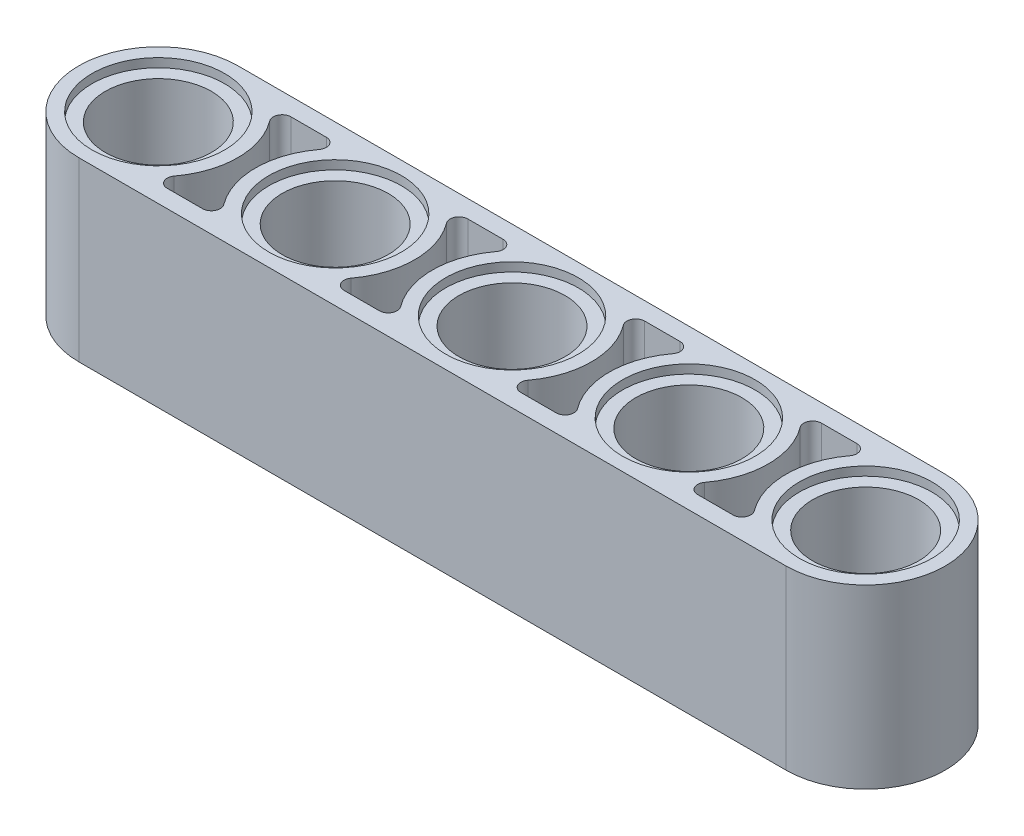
ISO-10303-21;
HEADER;
FILE_DESCRIPTION(('STEP AP214'),'2;1');
FILE_NAME('part.step','',(''),(''),'','','');
FILE_SCHEMA(('AUTOMOTIVE_DESIGN { 1 0 10303 214 1 1 1 1 }'));
ENDSEC;
DATA;
#1=APPLICATION_CONTEXT('core data for automotive mechanical design processes');
#2=APPLICATION_PROTOCOL_DEFINITION('international standard','automotive_design',2000,#1);
#3=PRODUCT_CONTEXT('',#1,'mechanical');
#4=PRODUCT('Part','Part','',(#3));
#5=PRODUCT_RELATED_PRODUCT_CATEGORY('part','',(#4));
#6=PRODUCT_DEFINITION_FORMATION('','',#4);
#7=PRODUCT_DEFINITION_CONTEXT('part definition',#1,'design');
#8=PRODUCT_DEFINITION('design','',#6,#7);
#9=PRODUCT_DEFINITION_SHAPE('','',#8);
#10=(LENGTH_UNIT() NAMED_UNIT(*) SI_UNIT(.MILLI.,.METRE.));
#11=(NAMED_UNIT(*) PLANE_ANGLE_UNIT() SI_UNIT($,.RADIAN.));
#12=(NAMED_UNIT(*) SI_UNIT($,.STERADIAN.) SOLID_ANGLE_UNIT());
#13=UNCERTAINTY_MEASURE_WITH_UNIT(LENGTH_MEASURE(1.E-05),#10,'distance_accuracy_value','');
#14=(GEOMETRIC_REPRESENTATION_CONTEXT(3) GLOBAL_UNCERTAINTY_ASSIGNED_CONTEXT((#13)) GLOBAL_UNIT_ASSIGNED_CONTEXT((#10,
#11,#12)) REPRESENTATION_CONTEXT('',''));
#15=CARTESIAN_POINT('',(0.,0.,0.));
#16=DIRECTION('',(0.,0.,1.));
#17=DIRECTION('',(1.,0.,0.));
#18=AXIS2_PLACEMENT_3D('',#15,#16,#17);
#19=CARTESIAN_POINT('',(3.2,4.8,-2.8));
#20=DIRECTION('',(0.,0.,-1.));
#21=DIRECTION('',(-1.,0.,0.));
#22=AXIS2_PLACEMENT_3D('',#19,#20,#21);
#23=PLANE('',#22);
#24=DIRECTION('',(0.,1.,0.));
#25=VECTOR('',#24,1.);
#26=CARTESIAN_POINT('',(3.2,4.8,-2.8));
#27=LINE('',#26,#25);
#28=CARTESIAN_POINT('',(3.2,8.,-2.8));
#29=VERTEX_POINT('',#28);
#30=CARTESIAN_POINT('',(3.2,4.8,-2.8));
#31=VERTEX_POINT('',#30);
#32=EDGE_CURVE('E457',#29,#31,#27,.F.);
#33=ORIENTED_EDGE('',*,*,#32,.T.);
#34=DIRECTION('',(-1.,0.,0.));
#35=VECTOR('',#34,1.);
#36=CARTESIAN_POINT('',(3.2,4.8,-2.8));
#37=LINE('',#36,#35);
#38=CARTESIAN_POINT('',(4.8,4.8,-2.8));
#39=VERTEX_POINT('',#38);
#40=EDGE_CURVE('E474',#39,#31,#37,.T.);
#41=ORIENTED_EDGE('',*,*,#40,.F.);
#42=DIRECTION('',(0.,1.,0.));
#43=VECTOR('',#42,1.);
#44=CARTESIAN_POINT('',(4.8,4.8,-2.8));
#45=LINE('',#44,#43);
#46=CARTESIAN_POINT('',(4.8,8.,-2.8));
#47=VERTEX_POINT('',#46);
#48=EDGE_CURVE('E467',#39,#47,#45,.T.);
#49=ORIENTED_EDGE('',*,*,#48,.T.);
#50=DIRECTION('',(-1.,0.,0.));
#51=VECTOR('',#50,1.);
#52=CARTESIAN_POINT('',(3.2,8.,-2.8));
#53=LINE('',#52,#51);
#54=EDGE_CURVE('E448',#29,#47,#53,.F.);
#55=ORIENTED_EDGE('',*,*,#54,.F.);
#56=EDGE_LOOP('',(#33,#41,#49,#55));
#57=FACE_BOUND('',#56,.T.);
#58=ADVANCED_FACE('F16',(#57),#23,.F.);
#59=CARTESIAN_POINT('',(4.8,4.8,2.8));
#60=DIRECTION('',(0.,0.,1.));
#61=DIRECTION('',(1.,0.,0.));
#62=AXIS2_PLACEMENT_3D('',#59,#60,#61);
#63=PLANE('',#62);
#64=DIRECTION('',(0.,1.,0.));
#65=VECTOR('',#64,1.);
#66=CARTESIAN_POINT('',(4.8,4.8,2.8));
#67=LINE('',#66,#65);
#68=CARTESIAN_POINT('',(4.8,8.,2.8));
#69=VERTEX_POINT('',#68);
#70=CARTESIAN_POINT('',(4.8,4.8,2.8));
#71=VERTEX_POINT('',#70);
#72=EDGE_CURVE('E890',#69,#71,#67,.F.);
#73=ORIENTED_EDGE('',*,*,#72,.T.);
#74=DIRECTION('',(1.,0.,0.));
#75=VECTOR('',#74,1.);
#76=CARTESIAN_POINT('',(3.2,4.8,2.8));
#77=LINE('',#76,#75);
#78=CARTESIAN_POINT('',(3.2,4.8,2.8));
#79=VERTEX_POINT('',#78);
#80=EDGE_CURVE('E460',#71,#79,#77,.F.);
#81=ORIENTED_EDGE('',*,*,#80,.T.);
#82=DIRECTION('',(0.,1.,0.));
#83=VECTOR('',#82,1.);
#84=CARTESIAN_POINT('',(3.2,4.8,2.8));
#85=LINE('',#84,#83);
#86=CARTESIAN_POINT('',(3.2,8.,2.8));
#87=VERTEX_POINT('',#86);
#88=EDGE_CURVE('E453',#79,#87,#85,.T.);
#89=ORIENTED_EDGE('',*,*,#88,.T.);
#90=DIRECTION('',(1.,0.,0.));
#91=VECTOR('',#90,1.);
#92=CARTESIAN_POINT('',(4.8,8.,2.8));
#93=LINE('',#92,#91);
#94=EDGE_CURVE('E436',#69,#87,#93,.F.);
#95=ORIENTED_EDGE('',*,*,#94,.F.);
#96=EDGE_LOOP('',(#73,#81,#89,#95));
#97=FACE_BOUND('',#96,.T.);
#98=ADVANCED_FACE('F459',(#97),#63,.F.);
#99=CARTESIAN_POINT('',(11.2,4.8,-2.8));
#100=DIRECTION('',(0.,0.,-1.));
#101=DIRECTION('',(-1.,0.,0.));
#102=AXIS2_PLACEMENT_3D('',#99,#100,#101);
#103=PLANE('',#102);
#104=DIRECTION('',(0.,1.,0.));
#105=VECTOR('',#104,1.);
#106=CARTESIAN_POINT('',(11.2,4.8,-2.8));
#107=LINE('',#106,#105);
#108=CARTESIAN_POINT('',(11.2,8.,-2.8));
#109=VERTEX_POINT('',#108);
#110=CARTESIAN_POINT('',(11.2,4.8,-2.8));
#111=VERTEX_POINT('',#110);
#112=EDGE_CURVE('E882',#109,#111,#107,.F.);
#113=ORIENTED_EDGE('',*,*,#112,.T.);
#114=DIRECTION('',(-1.,0.,0.));
#115=VECTOR('',#114,1.);
#116=CARTESIAN_POINT('',(11.2,4.8,-2.8));
#117=LINE('',#116,#115);
#118=CARTESIAN_POINT('',(12.8,4.8,-2.8));
#119=VERTEX_POINT('',#118);
#120=EDGE_CURVE('E447',#119,#111,#117,.T.);
#121=ORIENTED_EDGE('',*,*,#120,.F.);
#122=DIRECTION('',(0.,1.,0.));
#123=VECTOR('',#122,1.);
#124=CARTESIAN_POINT('',(12.8,4.8,-2.8));
#125=LINE('',#124,#123);
#126=CARTESIAN_POINT('',(12.8,8.,-2.8));
#127=VERTEX_POINT('',#126);
#128=EDGE_CURVE('E878',#119,#127,#125,.T.);
#129=ORIENTED_EDGE('',*,*,#128,.T.);
#130=DIRECTION('',(-1.,0.,0.));
#131=VECTOR('',#130,1.);
#132=CARTESIAN_POINT('',(11.2,8.,-2.8));
#133=LINE('',#132,#131);
#134=EDGE_CURVE('E1014',#109,#127,#133,.F.);
#135=ORIENTED_EDGE('',*,*,#134,.F.);
#136=EDGE_LOOP('',(#113,#121,#129,#135));
#137=FACE_BOUND('',#136,.T.);
#138=ADVANCED_FACE('F2017',(#137),#103,.F.);
#139=CARTESIAN_POINT('',(12.8,4.8,2.8));
#140=DIRECTION('',(0.,0.,1.));
#141=DIRECTION('',(1.,0.,0.));
#142=AXIS2_PLACEMENT_3D('',#139,#140,#141);
#143=PLANE('',#142);
#144=DIRECTION('',(0.,1.,0.));
#145=VECTOR('',#144,1.);
#146=CARTESIAN_POINT('',(12.8,4.8,2.8));
#147=LINE('',#146,#145);
#148=CARTESIAN_POINT('',(12.8,8.,2.8));
#149=VERTEX_POINT('',#148);
#150=CARTESIAN_POINT('',(12.8,4.8,2.8));
#151=VERTEX_POINT('',#150);
#152=EDGE_CURVE('E865',#149,#151,#147,.F.);
#153=ORIENTED_EDGE('',*,*,#152,.T.);
#154=DIRECTION('',(1.,0.,0.));
#155=VECTOR('',#154,1.);
#156=CARTESIAN_POINT('',(11.2,4.8,2.8));
#157=LINE('',#156,#155);
#158=CARTESIAN_POINT('',(11.2,4.8,2.8));
#159=VERTEX_POINT('',#158);
#160=EDGE_CURVE('E869',#151,#159,#157,.F.);
#161=ORIENTED_EDGE('',*,*,#160,.T.);
#162=DIRECTION('',(0.,1.,0.));
#163=VECTOR('',#162,1.);
#164=CARTESIAN_POINT('',(11.2,4.8,2.8));
#165=LINE('',#164,#163);
#166=CARTESIAN_POINT('',(11.2,8.,2.8));
#167=VERTEX_POINT('',#166);
#168=EDGE_CURVE('E885',#159,#167,#165,.T.);
#169=ORIENTED_EDGE('',*,*,#168,.T.);
#170=DIRECTION('',(1.,0.,0.));
#171=VECTOR('',#170,1.);
#172=CARTESIAN_POINT('',(12.8,8.,2.8));
#173=LINE('',#172,#171);
#174=EDGE_CURVE('E1009',#149,#167,#173,.F.);
#175=ORIENTED_EDGE('',*,*,#174,.F.);
#176=EDGE_LOOP('',(#153,#161,#169,#175));
#177=FACE_BOUND('',#176,.T.);
#178=ADVANCED_FACE('F2008',(#177),#143,.F.);
#179=CARTESIAN_POINT('',(19.2,4.8,-2.8));
#180=DIRECTION('',(0.,0.,-1.));
#181=DIRECTION('',(-1.,0.,0.));
#182=AXIS2_PLACEMENT_3D('',#179,#180,#181);
#183=PLANE('',#182);
#184=DIRECTION('',(0.,1.,0.));
#185=VECTOR('',#184,1.);
#186=CARTESIAN_POINT('',(19.2,4.8,-2.8));
#187=LINE('',#186,#185);
#188=CARTESIAN_POINT('',(19.2,8.,-2.8));
#189=VERTEX_POINT('',#188);
#190=CARTESIAN_POINT('',(19.2,4.8,-2.8));
#191=VERTEX_POINT('',#190);
#192=EDGE_CURVE('E855',#189,#191,#187,.F.);
#193=ORIENTED_EDGE('',*,*,#192,.T.);
#194=DIRECTION('',(-1.,0.,0.));
#195=VECTOR('',#194,1.);
#196=CARTESIAN_POINT('',(19.2,4.8,-2.8));
#197=LINE('',#196,#195);
#198=CARTESIAN_POINT('',(20.8,4.8,-2.8));
#199=VERTEX_POINT('',#198);
#200=EDGE_CURVE('E1007',#199,#191,#197,.T.);
#201=ORIENTED_EDGE('',*,*,#200,.F.);
#202=DIRECTION('',(0.,1.,0.));
#203=VECTOR('',#202,1.);
#204=CARTESIAN_POINT('',(20.8,4.8,-2.8));
#205=LINE('',#204,#203);
#206=CARTESIAN_POINT('',(20.8,8.,-2.8));
#207=VERTEX_POINT('',#206);
#208=EDGE_CURVE('E851',#199,#207,#205,.T.);
#209=ORIENTED_EDGE('',*,*,#208,.T.);
#210=DIRECTION('',(-1.,0.,0.));
#211=VECTOR('',#210,1.);
#212=CARTESIAN_POINT('',(19.2,8.,-2.8));
#213=LINE('',#212,#211);
#214=EDGE_CURVE('E1000',#189,#207,#213,.F.);
#215=ORIENTED_EDGE('',*,*,#214,.F.);
#216=EDGE_LOOP('',(#193,#201,#209,#215));
#217=FACE_BOUND('',#216,.T.);
#218=ADVANCED_FACE('F1999',(#217),#183,.F.);
#219=CARTESIAN_POINT('',(20.8,4.8,2.8));
#220=DIRECTION('',(0.,0.,1.));
#221=DIRECTION('',(1.,0.,0.));
#222=AXIS2_PLACEMENT_3D('',#219,#220,#221);
#223=PLANE('',#222);
#224=DIRECTION('',(0.,1.,0.));
#225=VECTOR('',#224,1.);
#226=CARTESIAN_POINT('',(20.8,4.8,2.8));
#227=LINE('',#226,#225);
#228=CARTESIAN_POINT('',(20.8,8.,2.8));
#229=VERTEX_POINT('',#228);
#230=CARTESIAN_POINT('',(20.8,4.8,2.8));
#231=VERTEX_POINT('',#230);
#232=EDGE_CURVE('E838',#229,#231,#227,.F.);
#233=ORIENTED_EDGE('',*,*,#232,.T.);
#234=DIRECTION('',(1.,0.,0.));
#235=VECTOR('',#234,1.);
#236=CARTESIAN_POINT('',(19.2,4.8,2.8));
#237=LINE('',#236,#235);
#238=CARTESIAN_POINT('',(19.2,4.8,2.8));
#239=VERTEX_POINT('',#238);
#240=EDGE_CURVE('E842',#231,#239,#237,.F.);
#241=ORIENTED_EDGE('',*,*,#240,.T.);
#242=DIRECTION('',(0.,1.,0.));
#243=VECTOR('',#242,1.);
#244=CARTESIAN_POINT('',(19.2,4.8,2.8));
#245=LINE('',#244,#243);
#246=CARTESIAN_POINT('',(19.2,8.,2.8));
#247=VERTEX_POINT('',#246);
#248=EDGE_CURVE('E858',#239,#247,#245,.T.);
#249=ORIENTED_EDGE('',*,*,#248,.T.);
#250=DIRECTION('',(1.,0.,0.));
#251=VECTOR('',#250,1.);
#252=CARTESIAN_POINT('',(20.8,8.,2.8));
#253=LINE('',#252,#251);
#254=EDGE_CURVE('E995',#229,#247,#253,.F.);
#255=ORIENTED_EDGE('',*,*,#254,.F.);
#256=EDGE_LOOP('',(#233,#241,#249,#255));
#257=FACE_BOUND('',#256,.T.);
#258=ADVANCED_FACE('F1990',(#257),#223,.F.);
#259=CARTESIAN_POINT('',(27.2,4.8,-2.8));
#260=DIRECTION('',(0.,0.,-1.));
#261=DIRECTION('',(-1.,0.,0.));
#262=AXIS2_PLACEMENT_3D('',#259,#260,#261);
#263=PLANE('',#262);
#264=DIRECTION('',(0.,1.,0.));
#265=VECTOR('',#264,1.);
#266=CARTESIAN_POINT('',(27.2,4.8,-2.8));
#267=LINE('',#266,#265);
#268=CARTESIAN_POINT('',(27.2,8.,-2.8));
#269=VERTEX_POINT('',#268);
#270=CARTESIAN_POINT('',(27.2,4.8,-2.8));
#271=VERTEX_POINT('',#270);
#272=EDGE_CURVE('E828',#269,#271,#267,.F.);
#273=ORIENTED_EDGE('',*,*,#272,.T.);
#274=DIRECTION('',(-1.,0.,0.));
#275=VECTOR('',#274,1.);
#276=CARTESIAN_POINT('',(27.2,4.8,-2.8));
#277=LINE('',#276,#275);
#278=CARTESIAN_POINT('',(28.8,4.8,-2.8));
#279=VERTEX_POINT('',#278);
#280=EDGE_CURVE('E993',#279,#271,#277,.T.);
#281=ORIENTED_EDGE('',*,*,#280,.F.);
#282=DIRECTION('',(0.,1.,0.));
#283=VECTOR('',#282,1.);
#284=CARTESIAN_POINT('',(28.8,4.8,-2.8));
#285=LINE('',#284,#283);
#286=CARTESIAN_POINT('',(28.8,8.,-2.8));
#287=VERTEX_POINT('',#286);
#288=EDGE_CURVE('E824',#279,#287,#285,.T.);
#289=ORIENTED_EDGE('',*,*,#288,.T.);
#290=DIRECTION('',(-1.,0.,0.));
#291=VECTOR('',#290,1.);
#292=CARTESIAN_POINT('',(27.2,8.,-2.8));
#293=LINE('',#292,#291);
#294=EDGE_CURVE('E986',#269,#287,#293,.F.);
#295=ORIENTED_EDGE('',*,*,#294,.F.);
#296=EDGE_LOOP('',(#273,#281,#289,#295));
#297=FACE_BOUND('',#296,.T.);
#298=ADVANCED_FACE('F1981',(#297),#263,.F.);
#299=CARTESIAN_POINT('',(28.8,4.8,2.8));
#300=DIRECTION('',(0.,0.,1.));
#301=DIRECTION('',(1.,0.,0.));
#302=AXIS2_PLACEMENT_3D('',#299,#300,#301);
#303=PLANE('',#302);
#304=DIRECTION('',(0.,1.,0.));
#305=VECTOR('',#304,1.);
#306=CARTESIAN_POINT('',(28.8,4.8,2.8));
#307=LINE('',#306,#305);
#308=CARTESIAN_POINT('',(28.8,8.,2.8));
#309=VERTEX_POINT('',#308);
#310=CARTESIAN_POINT('',(28.8,4.8,2.8));
#311=VERTEX_POINT('',#310);
#312=EDGE_CURVE('E811',#309,#311,#307,.F.);
#313=ORIENTED_EDGE('',*,*,#312,.T.);
#314=DIRECTION('',(1.,0.,0.));
#315=VECTOR('',#314,1.);
#316=CARTESIAN_POINT('',(27.2,4.8,2.8));
#317=LINE('',#316,#315);
#318=CARTESIAN_POINT('',(27.2,4.8,2.8));
#319=VERTEX_POINT('',#318);
#320=EDGE_CURVE('E815',#311,#319,#317,.F.);
#321=ORIENTED_EDGE('',*,*,#320,.T.);
#322=DIRECTION('',(0.,1.,0.));
#323=VECTOR('',#322,1.);
#324=CARTESIAN_POINT('',(27.2,4.8,2.8));
#325=LINE('',#324,#323);
#326=CARTESIAN_POINT('',(27.2,8.,2.8));
#327=VERTEX_POINT('',#326);
#328=EDGE_CURVE('E831',#319,#327,#325,.T.);
#329=ORIENTED_EDGE('',*,*,#328,.T.);
#330=DIRECTION('',(1.,0.,0.));
#331=VECTOR('',#330,1.);
#332=CARTESIAN_POINT('',(28.8,8.,2.8));
#333=LINE('',#332,#331);
#334=EDGE_CURVE('E982',#309,#327,#333,.F.);
#335=ORIENTED_EDGE('',*,*,#334,.F.);
#336=EDGE_LOOP('',(#313,#321,#329,#335));
#337=FACE_BOUND('',#336,.T.);
#338=ADVANCED_FACE('F1972',(#337),#303,.F.);
#339=CARTESIAN_POINT('',(12.8,3.2,2.8));
#340=DIRECTION('',(0.,0.,-1.));
#341=DIRECTION('',(-1.,0.,0.));
#342=AXIS2_PLACEMENT_3D('',#339,#340,#341);
#343=PLANE('',#342);
#344=DIRECTION('',(-1.,0.,0.));
#345=VECTOR('',#344,1.);
#346=CARTESIAN_POINT('',(12.8,3.2,2.8));
#347=LINE('',#346,#345);
#348=CARTESIAN_POINT('',(11.2,3.2,2.8));
#349=VERTEX_POINT('',#348);
#350=CARTESIAN_POINT('',(12.8,3.2,2.8));
#351=VERTEX_POINT('',#350);
#352=EDGE_CURVE('E972',#349,#351,#347,.F.);
#353=ORIENTED_EDGE('',*,*,#352,.T.);
#354=DIRECTION('',(0.,-1.,0.));
#355=VECTOR('',#354,1.);
#356=CARTESIAN_POINT('',(12.8,3.2,2.8));
#357=LINE('',#356,#355);
#358=CARTESIAN_POINT('',(12.8,0.,2.8));
#359=VERTEX_POINT('',#358);
#360=EDGE_CURVE('E782',#351,#359,#357,.T.);
#361=ORIENTED_EDGE('',*,*,#360,.T.);
#362=DIRECTION('',(-1.,0.,0.));
#363=VECTOR('',#362,1.);
#364=CARTESIAN_POINT('',(12.8,0.,2.8));
#365=LINE('',#364,#363);
#366=CARTESIAN_POINT('',(11.2,0.,2.8));
#367=VERTEX_POINT('',#366);
#368=EDGE_CURVE('E980',#359,#367,#365,.T.);
#369=ORIENTED_EDGE('',*,*,#368,.T.);
#370=DIRECTION('',(0.,-1.,0.));
#371=VECTOR('',#370,1.);
#372=CARTESIAN_POINT('',(11.2,3.2,2.8));
#373=LINE('',#372,#371);
#374=EDGE_CURVE('E786',#367,#349,#373,.F.);
#375=ORIENTED_EDGE('',*,*,#374,.T.);
#376=EDGE_LOOP('',(#353,#361,#369,#375));
#377=FACE_BOUND('',#376,.T.);
#378=ADVANCED_FACE('F1963',(#377),#343,.T.);
#379=CARTESIAN_POINT('',(11.2,3.2,-2.8));
#380=DIRECTION('',(0.,0.,1.));
#381=DIRECTION('',(1.,0.,0.));
#382=AXIS2_PLACEMENT_3D('',#379,#380,#381);
#383=PLANE('',#382);
#384=DIRECTION('',(1.,0.,0.));
#385=VECTOR('',#384,1.);
#386=CARTESIAN_POINT('',(11.2,3.2,-2.8));
#387=LINE('',#386,#385);
#388=CARTESIAN_POINT('',(12.8,3.2,-2.8));
#389=VERTEX_POINT('',#388);
#390=CARTESIAN_POINT('',(11.2,3.2,-2.8));
#391=VERTEX_POINT('',#390);
#392=EDGE_CURVE('E776',#389,#391,#387,.F.);
#393=ORIENTED_EDGE('',*,*,#392,.T.);
#394=DIRECTION('',(0.,-1.,0.));
#395=VECTOR('',#394,1.);
#396=CARTESIAN_POINT('',(11.2,3.2,-2.8));
#397=LINE('',#396,#395);
#398=CARTESIAN_POINT('',(11.2,0.,-2.8));
#399=VERTEX_POINT('',#398);
#400=EDGE_CURVE('E789',#391,#399,#397,.T.);
#401=ORIENTED_EDGE('',*,*,#400,.T.);
#402=DIRECTION('',(1.,0.,0.));
#403=VECTOR('',#402,1.);
#404=CARTESIAN_POINT('',(11.2,0.,-2.8));
#405=LINE('',#404,#403);
#406=CARTESIAN_POINT('',(12.8,0.,-2.8));
#407=VERTEX_POINT('',#406);
#408=EDGE_CURVE('E968',#399,#407,#405,.T.);
#409=ORIENTED_EDGE('',*,*,#408,.T.);
#410=DIRECTION('',(0.,-1.,0.));
#411=VECTOR('',#410,1.);
#412=CARTESIAN_POINT('',(12.8,3.2,-2.8));
#413=LINE('',#412,#411);
#414=EDGE_CURVE('E769',#407,#389,#413,.F.);
#415=ORIENTED_EDGE('',*,*,#414,.T.);
#416=EDGE_LOOP('',(#393,#401,#409,#415));
#417=FACE_BOUND('',#416,.T.);
#418=ADVANCED_FACE('F1954',(#417),#383,.T.);
#419=CARTESIAN_POINT('',(28.8,3.2,2.8));
#420=DIRECTION('',(0.,0.,-1.));
#421=DIRECTION('',(-1.,0.,0.));
#422=AXIS2_PLACEMENT_3D('',#419,#420,#421);
#423=PLANE('',#422);
#424=DIRECTION('',(-1.,0.,0.));
#425=VECTOR('',#424,1.);
#426=CARTESIAN_POINT('',(28.8,3.2,2.8));
#427=LINE('',#426,#425);
#428=CARTESIAN_POINT('',(27.2,3.2,2.8));
#429=VERTEX_POINT('',#428);
#430=CARTESIAN_POINT('',(28.8,3.2,2.8));
#431=VERTEX_POINT('',#430);
#432=EDGE_CURVE('E958',#429,#431,#427,.F.);
#433=ORIENTED_EDGE('',*,*,#432,.T.);
#434=DIRECTION('',(0.,-1.,0.));
#435=VECTOR('',#434,1.);
#436=CARTESIAN_POINT('',(28.8,3.2,2.8));
#437=LINE('',#436,#435);
#438=CARTESIAN_POINT('',(28.8,0.,2.8));
#439=VERTEX_POINT('',#438);
#440=EDGE_CURVE('E755',#431,#439,#437,.T.);
#441=ORIENTED_EDGE('',*,*,#440,.T.);
#442=DIRECTION('',(-1.,0.,0.));
#443=VECTOR('',#442,1.);
#444=CARTESIAN_POINT('',(28.8,0.,2.8));
#445=LINE('',#444,#443);
#446=CARTESIAN_POINT('',(27.2,0.,2.8));
#447=VERTEX_POINT('',#446);
#448=EDGE_CURVE('E966',#439,#447,#445,.T.);
#449=ORIENTED_EDGE('',*,*,#448,.T.);
#450=DIRECTION('',(0.,-1.,0.));
#451=VECTOR('',#450,1.);
#452=CARTESIAN_POINT('',(27.2,3.2,2.8));
#453=LINE('',#452,#451);
#454=EDGE_CURVE('E759',#447,#429,#453,.F.);
#455=ORIENTED_EDGE('',*,*,#454,.T.);
#456=EDGE_LOOP('',(#433,#441,#449,#455));
#457=FACE_BOUND('',#456,.T.);
#458=ADVANCED_FACE('F1945',(#457),#423,.T.);
#459=CARTESIAN_POINT('',(27.2,3.2,-2.8));
#460=DIRECTION('',(0.,0.,1.));
#461=DIRECTION('',(1.,0.,0.));
#462=AXIS2_PLACEMENT_3D('',#459,#460,#461);
#463=PLANE('',#462);
#464=DIRECTION('',(1.,0.,0.));
#465=VECTOR('',#464,1.);
#466=CARTESIAN_POINT('',(27.2,3.2,-2.8));
#467=LINE('',#466,#465);
#468=CARTESIAN_POINT('',(28.8,3.2,-2.8));
#469=VERTEX_POINT('',#468);
#470=CARTESIAN_POINT('',(27.2,3.2,-2.8));
#471=VERTEX_POINT('',#470);
#472=EDGE_CURVE('E749',#469,#471,#467,.F.);
#473=ORIENTED_EDGE('',*,*,#472,.T.);
#474=DIRECTION('',(0.,-1.,0.));
#475=VECTOR('',#474,1.);
#476=CARTESIAN_POINT('',(27.2,3.2,-2.8));
#477=LINE('',#476,#475);
#478=CARTESIAN_POINT('',(27.2,0.,-2.8));
#479=VERTEX_POINT('',#478);
#480=EDGE_CURVE('E762',#471,#479,#477,.T.);
#481=ORIENTED_EDGE('',*,*,#480,.T.);
#482=DIRECTION('',(1.,0.,0.));
#483=VECTOR('',#482,1.);
#484=CARTESIAN_POINT('',(27.2,0.,-2.8));
#485=LINE('',#484,#483);
#486=CARTESIAN_POINT('',(28.8,0.,-2.8));
#487=VERTEX_POINT('',#486);
#488=EDGE_CURVE('E954',#479,#487,#485,.T.);
#489=ORIENTED_EDGE('',*,*,#488,.T.);
#490=DIRECTION('',(0.,-1.,0.));
#491=VECTOR('',#490,1.);
#492=CARTESIAN_POINT('',(28.8,3.2,-2.8));
#493=LINE('',#492,#491);
#494=EDGE_CURVE('E742',#487,#469,#493,.F.);
#495=ORIENTED_EDGE('',*,*,#494,.T.);
#496=EDGE_LOOP('',(#473,#481,#489,#495));
#497=FACE_BOUND('',#496,.T.);
#498=ADVANCED_FACE('F1935',(#497),#463,.T.);
#499=CARTESIAN_POINT('',(0.,8.,0.));
#500=DIRECTION('',(0.,-1.,0.));
#501=DIRECTION('',(0.,0.,-1.));
#502=AXIS2_PLACEMENT_3D('',#499,#500,#501);
#503=CYLINDRICAL_SURFACE('',#502,2.4);
#504=CARTESIAN_POINT('',(0.,0.4,0.));
#505=DIRECTION('',(0.,-1.,0.));
#506=DIRECTION('',(0.,0.,-1.));
#507=AXIS2_PLACEMENT_3D('',#504,#505,#506);
#508=CIRCLE('',#507,2.4);
#509=CARTESIAN_POINT('',(0.,0.4,-2.4));
#510=VERTEX_POINT('',#509);
#511=EDGE_CURVE('E733',#510,#510,#508,.F.);
#512=ORIENTED_EDGE('',*,*,#511,.F.);
#513=EDGE_LOOP('',(#512));
#514=FACE_BOUND('',#513,.T.);
#515=CARTESIAN_POINT('',(0.,7.6,0.));
#516=DIRECTION('',(0.,-1.,0.));
#517=DIRECTION('',(0.,0.,-1.));
#518=AXIS2_PLACEMENT_3D('',#515,#516,#517);
#519=CIRCLE('',#518,2.4);
#520=CARTESIAN_POINT('',(0.,7.6,-2.4));
#521=VERTEX_POINT('',#520);
#522=EDGE_CURVE('E802',#521,#521,#519,.T.);
#523=ORIENTED_EDGE('',*,*,#522,.F.);
#524=EDGE_LOOP('',(#523));
#525=FACE_BOUND('',#524,.T.);
#526=ADVANCED_FACE('F1925',(#514,#525),#503,.F.);
#527=CARTESIAN_POINT('',(8.,8.,0.));
#528=DIRECTION('',(0.,-1.,0.));
#529=DIRECTION('',(0.,0.,-1.));
#530=AXIS2_PLACEMENT_3D('',#527,#528,#529);
#531=CYLINDRICAL_SURFACE('',#530,2.4);
#532=CARTESIAN_POINT('',(8.,0.4,0.));
#533=DIRECTION('',(0.,-1.,0.));
#534=DIRECTION('',(0.,0.,-1.));
#535=AXIS2_PLACEMENT_3D('',#532,#533,#534);
#536=CIRCLE('',#535,2.4);
#537=CARTESIAN_POINT('',(8.,0.4,-2.4));
#538=VERTEX_POINT('',#537);
#539=EDGE_CURVE('E730',#538,#538,#536,.F.);
#540=ORIENTED_EDGE('',*,*,#539,.F.);
#541=EDGE_LOOP('',(#540));
#542=FACE_BOUND('',#541,.T.);
#543=CARTESIAN_POINT('',(8.,7.6,0.));
#544=DIRECTION('',(0.,-1.,0.));
#545=DIRECTION('',(0.,0.,-1.));
#546=AXIS2_PLACEMENT_3D('',#543,#544,#545);
#547=CIRCLE('',#546,2.4);
#548=CARTESIAN_POINT('',(8.,7.6,-2.4));
#549=VERTEX_POINT('',#548);
#550=EDGE_CURVE('E799',#549,#549,#547,.T.);
#551=ORIENTED_EDGE('',*,*,#550,.F.);
#552=EDGE_LOOP('',(#551));
#553=FACE_BOUND('',#552,.T.);
#554=ADVANCED_FACE('F1915',(#542,#553),#531,.F.);
#555=CARTESIAN_POINT('',(16.,8.,0.));
#556=DIRECTION('',(0.,-1.,0.));
#557=DIRECTION('',(0.,0.,-1.));
#558=AXIS2_PLACEMENT_3D('',#555,#556,#557);
#559=CYLINDRICAL_SURFACE('',#558,2.4);
#560=CARTESIAN_POINT('',(16.,0.4,0.));
#561=DIRECTION('',(0.,-1.,0.));
#562=DIRECTION('',(0.,0.,-1.));
#563=AXIS2_PLACEMENT_3D('',#560,#561,#562);
#564=CIRCLE('',#563,2.4);
#565=CARTESIAN_POINT('',(16.,0.4,-2.4));
#566=VERTEX_POINT('',#565);
#567=EDGE_CURVE('E727',#566,#566,#564,.F.);
#568=ORIENTED_EDGE('',*,*,#567,.F.);
#569=EDGE_LOOP('',(#568));
#570=FACE_BOUND('',#569,.T.);
#571=CARTESIAN_POINT('',(16.,7.6,0.));
#572=DIRECTION('',(0.,-1.,0.));
#573=DIRECTION('',(0.,0.,-1.));
#574=AXIS2_PLACEMENT_3D('',#571,#572,#573);
#575=CIRCLE('',#574,2.4);
#576=CARTESIAN_POINT('',(16.,7.6,-2.4));
#577=VERTEX_POINT('',#576);
#578=EDGE_CURVE('E796',#577,#577,#575,.T.);
#579=ORIENTED_EDGE('',*,*,#578,.F.);
#580=EDGE_LOOP('',(#579));
#581=FACE_BOUND('',#580,.T.);
#582=ADVANCED_FACE('F1905',(#570,#581),#559,.F.);
#583=CARTESIAN_POINT('',(24.,8.,0.));
#584=DIRECTION('',(0.,-1.,0.));
#585=DIRECTION('',(0.,0.,-1.));
#586=AXIS2_PLACEMENT_3D('',#583,#584,#585);
#587=CYLINDRICAL_SURFACE('',#586,2.4);
#588=CARTESIAN_POINT('',(24.,0.4,0.));
#589=DIRECTION('',(0.,-1.,0.));
#590=DIRECTION('',(0.,0.,-1.));
#591=AXIS2_PLACEMENT_3D('',#588,#589,#590);
#592=CIRCLE('',#591,2.4);
#593=CARTESIAN_POINT('',(24.,0.4,-2.4));
#594=VERTEX_POINT('',#593);
#595=EDGE_CURVE('E724',#594,#594,#592,.F.);
#596=ORIENTED_EDGE('',*,*,#595,.F.);
#597=EDGE_LOOP('',(#596));
#598=FACE_BOUND('',#597,.T.);
#599=CARTESIAN_POINT('',(24.,7.6,0.));
#600=DIRECTION('',(0.,-1.,0.));
#601=DIRECTION('',(0.,0.,-1.));
#602=AXIS2_PLACEMENT_3D('',#599,#600,#601);
#603=CIRCLE('',#602,2.4);
#604=CARTESIAN_POINT('',(24.,7.6,-2.4));
#605=VERTEX_POINT('',#604);
#606=EDGE_CURVE('E793',#605,#605,#603,.T.);
#607=ORIENTED_EDGE('',*,*,#606,.F.);
#608=EDGE_LOOP('',(#607));
#609=FACE_BOUND('',#608,.T.);
#610=ADVANCED_FACE('F1896',(#598,#609),#587,.F.);
#611=CARTESIAN_POINT('',(32.,8.,0.));
#612=DIRECTION('',(0.,-1.,0.));
#613=DIRECTION('',(0.,0.,-1.));
#614=AXIS2_PLACEMENT_3D('',#611,#612,#613);
#615=CYLINDRICAL_SURFACE('',#614,2.4);
#616=CARTESIAN_POINT('',(32.,0.4,0.));
#617=DIRECTION('',(0.,-1.,0.));
#618=DIRECTION('',(0.,0.,-1.));
#619=AXIS2_PLACEMENT_3D('',#616,#617,#618);
#620=CIRCLE('',#619,2.4);
#621=CARTESIAN_POINT('',(32.,0.4,-2.4));
#622=VERTEX_POINT('',#621);
#623=EDGE_CURVE('E721',#622,#622,#620,.F.);
#624=ORIENTED_EDGE('',*,*,#623,.F.);
#625=EDGE_LOOP('',(#624));
#626=FACE_BOUND('',#625,.T.);
#627=CARTESIAN_POINT('',(32.,7.6,0.));
#628=DIRECTION('',(0.,-1.,0.));
#629=DIRECTION('',(0.,0.,-1.));
#630=AXIS2_PLACEMENT_3D('',#627,#628,#629);
#631=CIRCLE('',#630,2.4);
#632=CARTESIAN_POINT('',(32.,7.6,-2.4));
#633=VERTEX_POINT('',#632);
#634=EDGE_CURVE('E790',#633,#633,#631,.T.);
#635=ORIENTED_EDGE('',*,*,#634,.F.);
#636=EDGE_LOOP('',(#635));
#637=FACE_BOUND('',#636,.T.);
#638=ADVANCED_FACE('F1887',(#626,#637),#615,.F.);
#639=CARTESIAN_POINT('',(20.8,3.2,2.8));
#640=DIRECTION('',(0.,0.,-1.));
#641=DIRECTION('',(-1.,0.,0.));
#642=AXIS2_PLACEMENT_3D('',#639,#640,#641);
#643=PLANE('',#642);
#644=DIRECTION('',(-1.,0.,0.));
#645=VECTOR('',#644,1.);
#646=CARTESIAN_POINT('',(20.8,3.2,2.8));
#647=LINE('',#646,#645);
#648=CARTESIAN_POINT('',(19.2,3.2,2.8));
#649=VERTEX_POINT('',#648);
#650=CARTESIAN_POINT('',(20.8,3.2,2.8));
#651=VERTEX_POINT('',#650);
#652=EDGE_CURVE('E944',#649,#651,#647,.F.);
#653=ORIENTED_EDGE('',*,*,#652,.T.);
#654=DIRECTION('',(0.,-1.,0.));
#655=VECTOR('',#654,1.);
#656=CARTESIAN_POINT('',(20.8,3.2,2.8));
#657=LINE('',#656,#655);
#658=CARTESIAN_POINT('',(20.8,0.,2.8));
#659=VERTEX_POINT('',#658);
#660=EDGE_CURVE('E713',#651,#659,#657,.T.);
#661=ORIENTED_EDGE('',*,*,#660,.T.);
#662=DIRECTION('',(-1.,0.,0.));
#663=VECTOR('',#662,1.);
#664=CARTESIAN_POINT('',(20.8,0.,2.8));
#665=LINE('',#664,#663);
#666=CARTESIAN_POINT('',(19.2,0.,2.8));
#667=VERTEX_POINT('',#666);
#668=EDGE_CURVE('E952',#659,#667,#665,.T.);
#669=ORIENTED_EDGE('',*,*,#668,.T.);
#670=DIRECTION('',(0.,-1.,0.));
#671=VECTOR('',#670,1.);
#672=CARTESIAN_POINT('',(19.2,3.2,2.8));
#673=LINE('',#672,#671);
#674=EDGE_CURVE('E717',#667,#649,#673,.F.);
#675=ORIENTED_EDGE('',*,*,#674,.T.);
#676=EDGE_LOOP('',(#653,#661,#669,#675));
#677=FACE_BOUND('',#676,.T.);
#678=ADVANCED_FACE('F1878',(#677),#643,.T.);
#679=CARTESIAN_POINT('',(19.2,3.2,-2.8));
#680=DIRECTION('',(0.,0.,1.));
#681=DIRECTION('',(1.,0.,0.));
#682=AXIS2_PLACEMENT_3D('',#679,#680,#681);
#683=PLANE('',#682);
#684=DIRECTION('',(1.,0.,0.));
#685=VECTOR('',#684,1.);
#686=CARTESIAN_POINT('',(19.2,3.2,-2.8));
#687=LINE('',#686,#685);
#688=CARTESIAN_POINT('',(20.8,3.2,-2.8));
#689=VERTEX_POINT('',#688);
#690=CARTESIAN_POINT('',(19.2,3.2,-2.8));
#691=VERTEX_POINT('',#690);
#692=EDGE_CURVE('E707',#689,#691,#687,.F.);
#693=ORIENTED_EDGE('',*,*,#692,.T.);
#694=DIRECTION('',(0.,-1.,0.));
#695=VECTOR('',#694,1.);
#696=CARTESIAN_POINT('',(19.2,3.2,-2.8));
#697=LINE('',#696,#695);
#698=CARTESIAN_POINT('',(19.2,0.,-2.8));
#699=VERTEX_POINT('',#698);
#700=EDGE_CURVE('E720',#691,#699,#697,.T.);
#701=ORIENTED_EDGE('',*,*,#700,.T.);
#702=DIRECTION('',(1.,0.,0.));
#703=VECTOR('',#702,1.);
#704=CARTESIAN_POINT('',(19.2,0.,-2.8));
#705=LINE('',#704,#703);
#706=CARTESIAN_POINT('',(20.8,0.,-2.8));
#707=VERTEX_POINT('',#706);
#708=EDGE_CURVE('E940',#699,#707,#705,.T.);
#709=ORIENTED_EDGE('',*,*,#708,.T.);
#710=DIRECTION('',(0.,-1.,0.));
#711=VECTOR('',#710,1.);
#712=CARTESIAN_POINT('',(20.8,3.2,-2.8));
#713=LINE('',#712,#711);
#714=EDGE_CURVE('E700',#707,#689,#713,.F.);
#715=ORIENTED_EDGE('',*,*,#714,.T.);
#716=EDGE_LOOP('',(#693,#701,#709,#715));
#717=FACE_BOUND('',#716,.T.);
#718=ADVANCED_FACE('F1869',(#717),#683,.T.);
#719=CARTESIAN_POINT('',(4.8,3.2,2.8));
#720=DIRECTION('',(0.,0.,-1.));
#721=DIRECTION('',(-1.,0.,0.));
#722=AXIS2_PLACEMENT_3D('',#719,#720,#721);
#723=PLANE('',#722);
#724=DIRECTION('',(-1.,0.,0.));
#725=VECTOR('',#724,1.);
#726=CARTESIAN_POINT('',(4.8,3.2,2.8));
#727=LINE('',#726,#725);
#728=CARTESIAN_POINT('',(3.2,3.2,2.8));
#729=VERTEX_POINT('',#728);
#730=CARTESIAN_POINT('',(4.8,3.2,2.8));
#731=VERTEX_POINT('',#730);
#732=EDGE_CURVE('E463',#729,#731,#727,.F.);
#733=ORIENTED_EDGE('',*,*,#732,.T.);
#734=DIRECTION('',(0.,-1.,0.));
#735=VECTOR('',#734,1.);
#736=CARTESIAN_POINT('',(4.8,3.2,2.8));
#737=LINE('',#736,#735);
#738=CARTESIAN_POINT('',(4.8,0.,2.8));
#739=VERTEX_POINT('',#738);
#740=EDGE_CURVE('E686',#731,#739,#737,.T.);
#741=ORIENTED_EDGE('',*,*,#740,.T.);
#742=DIRECTION('',(-1.,0.,0.));
#743=VECTOR('',#742,1.);
#744=CARTESIAN_POINT('',(4.8,0.,2.8));
#745=LINE('',#744,#743);
#746=CARTESIAN_POINT('',(3.2,0.,2.8));
#747=VERTEX_POINT('',#746);
#748=EDGE_CURVE('E938',#739,#747,#745,.T.);
#749=ORIENTED_EDGE('',*,*,#748,.T.);
#750=DIRECTION('',(0.,-1.,0.));
#751=VECTOR('',#750,1.);
#752=CARTESIAN_POINT('',(3.2,3.2,2.8));
#753=LINE('',#752,#751);
#754=EDGE_CURVE('E690',#747,#729,#753,.F.);
#755=ORIENTED_EDGE('',*,*,#754,.T.);
#756=EDGE_LOOP('',(#733,#741,#749,#755));
#757=FACE_BOUND('',#756,.T.);
#758=ADVANCED_FACE('F1860',(#757),#723,.T.);
#759=CARTESIAN_POINT('',(3.2,3.2,-2.8));
#760=DIRECTION('',(0.,0.,1.));
#761=DIRECTION('',(1.,0.,0.));
#762=AXIS2_PLACEMENT_3D('',#759,#760,#761);
#763=PLANE('',#762);
#764=DIRECTION('',(1.,0.,0.));
#765=VECTOR('',#764,1.);
#766=CARTESIAN_POINT('',(3.2,3.2,-2.8));
#767=LINE('',#766,#765);
#768=CARTESIAN_POINT('',(4.8,3.2,-2.8));
#769=VERTEX_POINT('',#768);
#770=CARTESIAN_POINT('',(3.2,3.2,-2.8));
#771=VERTEX_POINT('',#770);
#772=EDGE_CURVE('E680',#769,#771,#767,.F.);
#773=ORIENTED_EDGE('',*,*,#772,.T.);
#774=DIRECTION('',(0.,-1.,0.));
#775=VECTOR('',#774,1.);
#776=CARTESIAN_POINT('',(3.2,3.2,-2.8));
#777=LINE('',#776,#775);
#778=CARTESIAN_POINT('',(3.2,0.,-2.8));
#779=VERTEX_POINT('',#778);
#780=EDGE_CURVE('E693',#771,#779,#777,.T.);
#781=ORIENTED_EDGE('',*,*,#780,.T.);
#782=DIRECTION('',(1.,0.,0.));
#783=VECTOR('',#782,1.);
#784=CARTESIAN_POINT('',(3.2,0.,-2.8));
#785=LINE('',#784,#783);
#786=CARTESIAN_POINT('',(4.8,0.,-2.8));
#787=VERTEX_POINT('',#786);
#788=EDGE_CURVE('E461',#779,#787,#785,.T.);
#789=ORIENTED_EDGE('',*,*,#788,.T.);
#790=DIRECTION('',(0.,-1.,0.));
#791=VECTOR('',#790,1.);
#792=CARTESIAN_POINT('',(4.8,3.2,-2.8));
#793=LINE('',#792,#791);
#794=EDGE_CURVE('E673',#787,#769,#793,.F.);
#795=ORIENTED_EDGE('',*,*,#794,.T.);
#796=EDGE_LOOP('',(#773,#781,#789,#795));
#797=FACE_BOUND('',#796,.T.);
#798=ADVANCED_FACE('F1852',(#797),#763,.T.);
#799=CARTESIAN_POINT('',(3.2,4.8,2.4));
#800=DIRECTION('',(0.,1.,0.));
#801=DIRECTION('',(0.,0.,1.));
#802=AXIS2_PLACEMENT_3D('',#799,#800,#801);
#803=CYLINDRICAL_SURFACE('',#802,0.4);
#804=ORIENTED_EDGE('',*,*,#88,.F.);
#805=CARTESIAN_POINT('',(3.2,4.8,2.4));
#806=DIRECTION('',(0.,1.,0.));
#807=DIRECTION('',(0.,0.,1.));
#808=AXIS2_PLACEMENT_3D('',#805,#806,#807);
#809=CIRCLE('',#808,0.4);
#810=CARTESIAN_POINT('',(2.88,4.8,2.16));
#811=VERTEX_POINT('',#810);
#812=EDGE_CURVE('E891',#79,#811,#809,.F.);
#813=ORIENTED_EDGE('',*,*,#812,.T.);
#814=DIRECTION('',(0.,1.,0.));
#815=VECTOR('',#814,1.);
#816=CARTESIAN_POINT('',(2.88,4.8,2.16));
#817=LINE('',#816,#815);
#818=CARTESIAN_POINT('',(2.88,8.,2.16));
#819=VERTEX_POINT('',#818);
#820=EDGE_CURVE('E455',#819,#811,#817,.F.);
#821=ORIENTED_EDGE('',*,*,#820,.F.);
#822=CARTESIAN_POINT('',(3.2,8.,2.4));
#823=DIRECTION('',(0.,1.,0.));
#824=DIRECTION('',(0.,0.,1.));
#825=AXIS2_PLACEMENT_3D('',#822,#823,#824);
#826=CIRCLE('',#825,0.4);
#827=EDGE_CURVE('E19',#87,#819,#826,.F.);
#828=ORIENTED_EDGE('',*,*,#827,.F.);
#829=EDGE_LOOP('',(#804,#813,#821,#828));
#830=FACE_BOUND('',#829,.T.);
#831=ADVANCED_FACE('F451',(#830),#803,.F.);
#832=CARTESIAN_POINT('',(3.2,4.8,-2.4));
#833=DIRECTION('',(0.,1.,0.));
#834=DIRECTION('',(0.,0.,1.));
#835=AXIS2_PLACEMENT_3D('',#832,#833,#834);
#836=CYLINDRICAL_SURFACE('',#835,0.4);
#837=DIRECTION('',(0.,1.,0.));
#838=VECTOR('',#837,1.);
#839=CARTESIAN_POINT('',(2.88,4.8,-2.16));
#840=LINE('',#839,#838);
#841=CARTESIAN_POINT('',(2.88,4.8,-2.16));
#842=VERTEX_POINT('',#841);
#843=CARTESIAN_POINT('',(2.88,8.,-2.16));
#844=VERTEX_POINT('',#843);
#845=EDGE_CURVE('E666',#842,#844,#840,.T.);
#846=ORIENTED_EDGE('',*,*,#845,.F.);
#847=CARTESIAN_POINT('',(3.2,4.8,-2.4));
#848=DIRECTION('',(0.,1.,0.));
#849=DIRECTION('',(0.,0.,1.));
#850=AXIS2_PLACEMENT_3D('',#847,#848,#849);
#851=CIRCLE('',#850,0.4);
#852=EDGE_CURVE('E896',#842,#31,#851,.F.);
#853=ORIENTED_EDGE('',*,*,#852,.T.);
#854=ORIENTED_EDGE('',*,*,#32,.F.);
#855=CARTESIAN_POINT('',(3.2,8.,-2.4));
#856=DIRECTION('',(0.,1.,0.));
#857=DIRECTION('',(0.,0.,1.));
#858=AXIS2_PLACEMENT_3D('',#855,#856,#857);
#859=CIRCLE('',#858,0.4);
#860=EDGE_CURVE('E471',#844,#29,#859,.F.);
#861=ORIENTED_EDGE('',*,*,#860,.F.);
#862=EDGE_LOOP('',(#846,#853,#854,#861));
#863=FACE_BOUND('',#862,.T.);
#864=ADVANCED_FACE('F905',(#863),#836,.F.);
#865=CARTESIAN_POINT('',(4.8,4.8,-2.4));
#866=DIRECTION('',(0.,1.,0.));
#867=DIRECTION('',(0.,0.,1.));
#868=AXIS2_PLACEMENT_3D('',#865,#866,#867);
#869=CYLINDRICAL_SURFACE('',#868,0.4);
#870=ORIENTED_EDGE('',*,*,#48,.F.);
#871=CARTESIAN_POINT('',(4.8,4.8,-2.4));
#872=DIRECTION('',(0.,1.,0.));
#873=DIRECTION('',(0.,0.,1.));
#874=AXIS2_PLACEMENT_3D('',#871,#872,#873);
#875=CIRCLE('',#874,0.4);
#876=CARTESIAN_POINT('',(5.12,4.8,-2.16));
#877=VERTEX_POINT('',#876);
#878=EDGE_CURVE('E893',#39,#877,#875,.F.);
#879=ORIENTED_EDGE('',*,*,#878,.T.);
#880=DIRECTION('',(0.,1.,0.));
#881=VECTOR('',#880,1.);
#882=CARTESIAN_POINT('',(5.12,4.8,-2.16));
#883=LINE('',#882,#881);
#884=CARTESIAN_POINT('',(5.12,8.,-2.16));
#885=VERTEX_POINT('',#884);
#886=EDGE_CURVE('E662',#885,#877,#883,.F.);
#887=ORIENTED_EDGE('',*,*,#886,.F.);
#888=CARTESIAN_POINT('',(4.8,8.,-2.4));
#889=DIRECTION('',(0.,1.,0.));
#890=DIRECTION('',(0.,0.,1.));
#891=AXIS2_PLACEMENT_3D('',#888,#889,#890);
#892=CIRCLE('',#891,0.4);
#893=EDGE_CURVE('E470',#47,#885,#892,.F.);
#894=ORIENTED_EDGE('',*,*,#893,.F.);
#895=EDGE_LOOP('',(#870,#879,#887,#894));
#896=FACE_BOUND('',#895,.T.);
#897=ADVANCED_FACE('F1034',(#896),#869,.F.);
#898=CARTESIAN_POINT('',(3.2,4.8,2.4));
#899=DIRECTION('',(0.,-1.,0.));
#900=DIRECTION('',(0.,0.,-1.));
#901=AXIS2_PLACEMENT_3D('',#898,#899,#900);
#902=PLANE('',#901);
#903=ORIENTED_EDGE('',*,*,#80,.F.);
#904=CARTESIAN_POINT('',(4.8,4.8,2.4));
#905=DIRECTION('',(0.,1.,0.));
#906=DIRECTION('',(0.,0.,1.));
#907=AXIS2_PLACEMENT_3D('',#904,#905,#906);
#908=CIRCLE('',#907,0.4);
#909=CARTESIAN_POINT('',(5.12,4.8,2.16));
#910=VERTEX_POINT('',#909);
#911=EDGE_CURVE('E887',#71,#910,#908,.T.);
#912=ORIENTED_EDGE('',*,*,#911,.T.);
#913=CARTESIAN_POINT('',(8.,4.8,0.));
#914=DIRECTION('',(0.,1.,0.));
#915=DIRECTION('',(0.,0.,1.));
#916=AXIS2_PLACEMENT_3D('',#913,#914,#915);
#917=CIRCLE('',#916,3.6);
#918=EDGE_CURVE('E659',#877,#910,#917,.T.);
#919=ORIENTED_EDGE('',*,*,#918,.F.);
#920=ORIENTED_EDGE('',*,*,#878,.F.);
#921=ORIENTED_EDGE('',*,*,#40,.T.);
#922=ORIENTED_EDGE('',*,*,#852,.F.);
#923=CARTESIAN_POINT('',(0.,4.8,0.));
#924=DIRECTION('',(0.,1.,0.));
#925=DIRECTION('',(0.,0.,1.));
#926=AXIS2_PLACEMENT_3D('',#923,#924,#925);
#927=CIRCLE('',#926,3.6);
#928=EDGE_CURVE('E663',#811,#842,#927,.T.);
#929=ORIENTED_EDGE('',*,*,#928,.F.);
#930=ORIENTED_EDGE('',*,*,#812,.F.);
#931=EDGE_LOOP('',(#903,#912,#919,#920,#921,#922,#929,#930));
#932=FACE_BOUND('',#931,.T.);
#933=ADVANCED_FACE('F1029',(#932),#902,.F.);
#934=CARTESIAN_POINT('',(4.8,4.8,2.4));
#935=DIRECTION('',(0.,1.,0.));
#936=DIRECTION('',(0.,0.,1.));
#937=AXIS2_PLACEMENT_3D('',#934,#935,#936);
#938=CYLINDRICAL_SURFACE('',#937,0.4);
#939=DIRECTION('',(0.,1.,0.));
#940=VECTOR('',#939,1.);
#941=CARTESIAN_POINT('',(5.12,4.8,2.16));
#942=LINE('',#941,#940);
#943=CARTESIAN_POINT('',(5.12,8.,2.16));
#944=VERTEX_POINT('',#943);
#945=EDGE_CURVE('E661',#910,#944,#942,.T.);
#946=ORIENTED_EDGE('',*,*,#945,.F.);
#947=ORIENTED_EDGE('',*,*,#911,.F.);
#948=ORIENTED_EDGE('',*,*,#72,.F.);
#949=CARTESIAN_POINT('',(4.8,8.,2.4));
#950=DIRECTION('',(0.,1.,0.));
#951=DIRECTION('',(0.,0.,1.));
#952=AXIS2_PLACEMENT_3D('',#949,#950,#951);
#953=CIRCLE('',#952,0.4);
#954=EDGE_CURVE('E442',#944,#69,#953,.F.);
#955=ORIENTED_EDGE('',*,*,#954,.F.);
#956=EDGE_LOOP('',(#946,#947,#948,#955));
#957=FACE_BOUND('',#956,.T.);
#958=ADVANCED_FACE('F1025',(#957),#938,.F.);
#959=CARTESIAN_POINT('',(11.2,4.8,2.4));
#960=DIRECTION('',(0.,1.,0.));
#961=DIRECTION('',(0.,0.,1.));
#962=AXIS2_PLACEMENT_3D('',#959,#960,#961);
#963=CYLINDRICAL_SURFACE('',#962,0.4);
#964=ORIENTED_EDGE('',*,*,#168,.F.);
#965=CARTESIAN_POINT('',(11.2,4.8,2.4));
#966=DIRECTION('',(0.,1.,0.));
#967=DIRECTION('',(0.,0.,1.));
#968=AXIS2_PLACEMENT_3D('',#965,#966,#967);
#969=CIRCLE('',#968,0.4);
#970=CARTESIAN_POINT('',(10.88,4.8,2.16));
#971=VERTEX_POINT('',#970);
#972=EDGE_CURVE('E866',#159,#971,#969,.F.);
#973=ORIENTED_EDGE('',*,*,#972,.T.);
#974=DIRECTION('',(0.,1.,0.));
#975=VECTOR('',#974,1.);
#976=CARTESIAN_POINT('',(10.88,4.8,2.16));
#977=LINE('',#976,#975);
#978=CARTESIAN_POINT('',(10.88,8.,2.16));
#979=VERTEX_POINT('',#978);
#980=EDGE_CURVE('E658',#979,#971,#977,.F.);
#981=ORIENTED_EDGE('',*,*,#980,.F.);
#982=CARTESIAN_POINT('',(11.2,8.,2.4));
#983=DIRECTION('',(0.,1.,0.));
#984=DIRECTION('',(0.,0.,1.));
#985=AXIS2_PLACEMENT_3D('',#982,#983,#984);
#986=CIRCLE('',#985,0.4);
#987=EDGE_CURVE('E883',#167,#979,#986,.F.);
#988=ORIENTED_EDGE('',*,*,#987,.F.);
#989=EDGE_LOOP('',(#964,#973,#981,#988));
#990=FACE_BOUND('',#989,.T.);
#991=ADVANCED_FACE('F1807',(#990),#963,.F.);
#992=CARTESIAN_POINT('',(11.2,4.8,-2.4));
#993=DIRECTION('',(0.,1.,0.));
#994=DIRECTION('',(0.,0.,1.));
#995=AXIS2_PLACEMENT_3D('',#992,#993,#994);
#996=CYLINDRICAL_SURFACE('',#995,0.4);
#997=DIRECTION('',(0.,1.,0.));
#998=VECTOR('',#997,1.);
#999=CARTESIAN_POINT('',(10.88,4.8,-2.16));
#1000=LINE('',#999,#998);
#1001=CARTESIAN_POINT('',(10.88,4.8,-2.16));
#1002=VERTEX_POINT('',#1001);
#1003=CARTESIAN_POINT('',(10.88,8.,-2.16));
#1004=VERTEX_POINT('',#1003);
#1005=EDGE_CURVE('E657',#1002,#1004,#1000,.T.);
#1006=ORIENTED_EDGE('',*,*,#1005,.F.);
#1007=CARTESIAN_POINT('',(11.2,4.8,-2.4));
#1008=DIRECTION('',(0.,1.,0.));
#1009=DIRECTION('',(0.,0.,1.));
#1010=AXIS2_PLACEMENT_3D('',#1007,#1008,#1009);
#1011=CIRCLE('',#1010,0.4);
#1012=EDGE_CURVE('E873',#1002,#111,#1011,.F.);
#1013=ORIENTED_EDGE('',*,*,#1012,.T.);
#1014=ORIENTED_EDGE('',*,*,#112,.F.);
#1015=CARTESIAN_POINT('',(11.2,8.,-2.4));
#1016=DIRECTION('',(0.,1.,0.));
#1017=DIRECTION('',(0.,0.,1.));
#1018=AXIS2_PLACEMENT_3D('',#1015,#1016,#1017);
#1019=CIRCLE('',#1018,0.4);
#1020=EDGE_CURVE('E879',#1004,#109,#1019,.F.);
#1021=ORIENTED_EDGE('',*,*,#1020,.F.);
#1022=EDGE_LOOP('',(#1006,#1013,#1014,#1021));
#1023=FACE_BOUND('',#1022,.T.);
#1024=ADVANCED_FACE('F1798',(#1023),#996,.F.);
#1025=CARTESIAN_POINT('',(12.8,4.8,-2.4));
#1026=DIRECTION('',(0.,1.,0.));
#1027=DIRECTION('',(0.,0.,1.));
#1028=AXIS2_PLACEMENT_3D('',#1025,#1026,#1027);
#1029=CYLINDRICAL_SURFACE('',#1028,0.4);
#1030=ORIENTED_EDGE('',*,*,#128,.F.);
#1031=CARTESIAN_POINT('',(12.8,4.8,-2.4));
#1032=DIRECTION('',(0.,1.,0.));
#1033=DIRECTION('',(0.,0.,1.));
#1034=AXIS2_PLACEMENT_3D('',#1031,#1032,#1033);
#1035=CIRCLE('',#1034,0.4);
#1036=CARTESIAN_POINT('',(13.12,4.8,-2.16));
#1037=VERTEX_POINT('',#1036);
#1038=EDGE_CURVE('E870',#119,#1037,#1035,.F.);
#1039=ORIENTED_EDGE('',*,*,#1038,.T.);
#1040=DIRECTION('',(0.,1.,0.));
#1041=VECTOR('',#1040,1.);
#1042=CARTESIAN_POINT('',(13.12,4.8,-2.16));
#1043=LINE('',#1042,#1041);
#1044=CARTESIAN_POINT('',(13.12,8.,-2.16));
#1045=VERTEX_POINT('',#1044);
#1046=EDGE_CURVE('E653',#1045,#1037,#1043,.F.);
#1047=ORIENTED_EDGE('',*,*,#1046,.F.);
#1048=CARTESIAN_POINT('',(12.8,8.,-2.4));
#1049=DIRECTION('',(0.,1.,0.));
#1050=DIRECTION('',(0.,0.,1.));
#1051=AXIS2_PLACEMENT_3D('',#1048,#1049,#1050);
#1052=CIRCLE('',#1051,0.4);
#1053=EDGE_CURVE('E876',#127,#1045,#1052,.F.);
#1054=ORIENTED_EDGE('',*,*,#1053,.F.);
#1055=EDGE_LOOP('',(#1030,#1039,#1047,#1054));
#1056=FACE_BOUND('',#1055,.T.);
#1057=ADVANCED_FACE('F1789',(#1056),#1029,.F.);
#1058=CARTESIAN_POINT('',(11.2,4.8,2.4));
#1059=DIRECTION('',(0.,-1.,0.));
#1060=DIRECTION('',(0.,0.,-1.));
#1061=AXIS2_PLACEMENT_3D('',#1058,#1059,#1060);
#1062=PLANE('',#1061);
#1063=ORIENTED_EDGE('',*,*,#160,.F.);
#1064=CARTESIAN_POINT('',(12.8,4.8,2.4));
#1065=DIRECTION('',(0.,1.,0.));
#1066=DIRECTION('',(0.,0.,1.));
#1067=AXIS2_PLACEMENT_3D('',#1064,#1065,#1066);
#1068=CIRCLE('',#1067,0.4);
#1069=CARTESIAN_POINT('',(13.12,4.8,2.16));
#1070=VERTEX_POINT('',#1069);
#1071=EDGE_CURVE('E862',#151,#1070,#1068,.T.);
#1072=ORIENTED_EDGE('',*,*,#1071,.T.);
#1073=CARTESIAN_POINT('',(16.,4.8,0.));
#1074=DIRECTION('',(0.,1.,0.));
#1075=DIRECTION('',(0.,0.,1.));
#1076=AXIS2_PLACEMENT_3D('',#1073,#1074,#1075);
#1077=CIRCLE('',#1076,3.6);
#1078=EDGE_CURVE('E650',#1037,#1070,#1077,.T.);
#1079=ORIENTED_EDGE('',*,*,#1078,.F.);
#1080=ORIENTED_EDGE('',*,*,#1038,.F.);
#1081=ORIENTED_EDGE('',*,*,#120,.T.);
#1082=ORIENTED_EDGE('',*,*,#1012,.F.);
#1083=CARTESIAN_POINT('',(8.,4.8,0.));
#1084=DIRECTION('',(0.,1.,0.));
#1085=DIRECTION('',(0.,0.,1.));
#1086=AXIS2_PLACEMENT_3D('',#1083,#1084,#1085);
#1087=CIRCLE('',#1086,3.6);
#1088=EDGE_CURVE('E654',#971,#1002,#1087,.T.);
#1089=ORIENTED_EDGE('',*,*,#1088,.F.);
#1090=ORIENTED_EDGE('',*,*,#972,.F.);
#1091=EDGE_LOOP('',(#1063,#1072,#1079,#1080,#1081,#1082,#1089,#1090));
#1092=FACE_BOUND('',#1091,.T.);
#1093=ADVANCED_FACE('F1780',(#1092),#1062,.F.);
#1094=CARTESIAN_POINT('',(12.8,4.8,2.4));
#1095=DIRECTION('',(0.,1.,0.));
#1096=DIRECTION('',(0.,0.,1.));
#1097=AXIS2_PLACEMENT_3D('',#1094,#1095,#1096);
#1098=CYLINDRICAL_SURFACE('',#1097,0.4);
#1099=DIRECTION('',(0.,1.,0.));
#1100=VECTOR('',#1099,1.);
#1101=CARTESIAN_POINT('',(13.12,4.8,2.16));
#1102=LINE('',#1101,#1100);
#1103=CARTESIAN_POINT('',(13.12,8.,2.16));
#1104=VERTEX_POINT('',#1103);
#1105=EDGE_CURVE('E652',#1070,#1104,#1102,.T.);
#1106=ORIENTED_EDGE('',*,*,#1105,.F.);
#1107=ORIENTED_EDGE('',*,*,#1071,.F.);
#1108=ORIENTED_EDGE('',*,*,#152,.F.);
#1109=CARTESIAN_POINT('',(12.8,8.,2.4));
#1110=DIRECTION('',(0.,1.,0.));
#1111=DIRECTION('',(0.,0.,1.));
#1112=AXIS2_PLACEMENT_3D('',#1109,#1110,#1111);
#1113=CIRCLE('',#1112,0.4);
#1114=EDGE_CURVE('E859',#1104,#149,#1113,.F.);
#1115=ORIENTED_EDGE('',*,*,#1114,.F.);
#1116=EDGE_LOOP('',(#1106,#1107,#1108,#1115));
#1117=FACE_BOUND('',#1116,.T.);
#1118=ADVANCED_FACE('F1771',(#1117),#1098,.F.);
#1119=CARTESIAN_POINT('',(19.2,4.8,2.4));
#1120=DIRECTION('',(0.,1.,0.));
#1121=DIRECTION('',(0.,0.,1.));
#1122=AXIS2_PLACEMENT_3D('',#1119,#1120,#1121);
#1123=CYLINDRICAL_SURFACE('',#1122,0.399999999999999);
#1124=ORIENTED_EDGE('',*,*,#248,.F.);
#1125=CARTESIAN_POINT('',(19.2,4.8,2.4));
#1126=DIRECTION('',(0.,1.,0.));
#1127=DIRECTION('',(0.,0.,1.));
#1128=AXIS2_PLACEMENT_3D('',#1125,#1126,#1127);
#1129=CIRCLE('',#1128,0.399999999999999);
#1130=CARTESIAN_POINT('',(18.88,4.8,2.16));
#1131=VERTEX_POINT('',#1130);
#1132=EDGE_CURVE('E839',#239,#1131,#1129,.F.);
#1133=ORIENTED_EDGE('',*,*,#1132,.T.);
#1134=DIRECTION('',(0.,1.,0.));
#1135=VECTOR('',#1134,1.);
#1136=CARTESIAN_POINT('',(18.88,4.8,2.16));
#1137=LINE('',#1136,#1135);
#1138=CARTESIAN_POINT('',(18.88,8.,2.16));
#1139=VERTEX_POINT('',#1138);
#1140=EDGE_CURVE('E649',#1139,#1131,#1137,.F.);
#1141=ORIENTED_EDGE('',*,*,#1140,.F.);
#1142=CARTESIAN_POINT('',(19.2,8.,2.4));
#1143=DIRECTION('',(0.,1.,0.));
#1144=DIRECTION('',(0.,0.,1.));
#1145=AXIS2_PLACEMENT_3D('',#1142,#1143,#1144);
#1146=CIRCLE('',#1145,0.399999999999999);
#1147=EDGE_CURVE('E856',#247,#1139,#1146,.F.);
#1148=ORIENTED_EDGE('',*,*,#1147,.F.);
#1149=EDGE_LOOP('',(#1124,#1133,#1141,#1148));
#1150=FACE_BOUND('',#1149,.T.);
#1151=ADVANCED_FACE('F1762',(#1150),#1123,.F.);
#1152=CARTESIAN_POINT('',(19.2,4.8,-2.4));
#1153=DIRECTION('',(0.,1.,0.));
#1154=DIRECTION('',(0.,0.,1.));
#1155=AXIS2_PLACEMENT_3D('',#1152,#1153,#1154);
#1156=CYLINDRICAL_SURFACE('',#1155,0.4);
#1157=DIRECTION('',(0.,1.,0.));
#1158=VECTOR('',#1157,1.);
#1159=CARTESIAN_POINT('',(18.88,4.8,-2.16));
#1160=LINE('',#1159,#1158);
#1161=CARTESIAN_POINT('',(18.88,4.8,-2.16));
#1162=VERTEX_POINT('',#1161);
#1163=CARTESIAN_POINT('',(18.88,8.,-2.16));
#1164=VERTEX_POINT('',#1163);
#1165=EDGE_CURVE('E648',#1162,#1164,#1160,.T.);
#1166=ORIENTED_EDGE('',*,*,#1165,.F.);
#1167=CARTESIAN_POINT('',(19.2,4.8,-2.4));
#1168=DIRECTION('',(0.,1.,0.));
#1169=DIRECTION('',(0.,0.,1.));
#1170=AXIS2_PLACEMENT_3D('',#1167,#1168,#1169);
#1171=CIRCLE('',#1170,0.4);
#1172=EDGE_CURVE('E846',#1162,#191,#1171,.F.);
#1173=ORIENTED_EDGE('',*,*,#1172,.T.);
#1174=ORIENTED_EDGE('',*,*,#192,.F.);
#1175=CARTESIAN_POINT('',(19.2,8.,-2.4));
#1176=DIRECTION('',(0.,1.,0.));
#1177=DIRECTION('',(0.,0.,1.));
#1178=AXIS2_PLACEMENT_3D('',#1175,#1176,#1177);
#1179=CIRCLE('',#1178,0.4);
#1180=EDGE_CURVE('E852',#1164,#189,#1179,.F.);
#1181=ORIENTED_EDGE('',*,*,#1180,.F.);
#1182=EDGE_LOOP('',(#1166,#1173,#1174,#1181));
#1183=FACE_BOUND('',#1182,.T.);
#1184=ADVANCED_FACE('F1753',(#1183),#1156,.F.);
#1185=CARTESIAN_POINT('',(20.8,4.8,-2.4));
#1186=DIRECTION('',(0.,1.,0.));
#1187=DIRECTION('',(0.,0.,1.));
#1188=AXIS2_PLACEMENT_3D('',#1185,#1186,#1187);
#1189=CYLINDRICAL_SURFACE('',#1188,0.4);
#1190=ORIENTED_EDGE('',*,*,#208,.F.);
#1191=CARTESIAN_POINT('',(20.8,4.8,-2.4));
#1192=DIRECTION('',(0.,1.,0.));
#1193=DIRECTION('',(0.,0.,1.));
#1194=AXIS2_PLACEMENT_3D('',#1191,#1192,#1193);
#1195=CIRCLE('',#1194,0.4);
#1196=CARTESIAN_POINT('',(21.12,4.8,-2.16));
#1197=VERTEX_POINT('',#1196);
#1198=EDGE_CURVE('E843',#199,#1197,#1195,.F.);
#1199=ORIENTED_EDGE('',*,*,#1198,.T.);
#1200=DIRECTION('',(0.,1.,0.));
#1201=VECTOR('',#1200,1.);
#1202=CARTESIAN_POINT('',(21.12,4.8,-2.16));
#1203=LINE('',#1202,#1201);
#1204=CARTESIAN_POINT('',(21.12,8.,-2.16));
#1205=VERTEX_POINT('',#1204);
#1206=EDGE_CURVE('E644',#1205,#1197,#1203,.F.);
#1207=ORIENTED_EDGE('',*,*,#1206,.F.);
#1208=CARTESIAN_POINT('',(20.8,8.,-2.4));
#1209=DIRECTION('',(0.,1.,0.));
#1210=DIRECTION('',(0.,0.,1.));
#1211=AXIS2_PLACEMENT_3D('',#1208,#1209,#1210);
#1212=CIRCLE('',#1211,0.4);
#1213=EDGE_CURVE('E849',#207,#1205,#1212,.F.);
#1214=ORIENTED_EDGE('',*,*,#1213,.F.);
#1215=EDGE_LOOP('',(#1190,#1199,#1207,#1214));
#1216=FACE_BOUND('',#1215,.T.);
#1217=ADVANCED_FACE('F1744',(#1216),#1189,.F.);
#1218=CARTESIAN_POINT('',(19.2,4.8,2.4));
#1219=DIRECTION('',(0.,-1.,0.));
#1220=DIRECTION('',(0.,0.,-1.));
#1221=AXIS2_PLACEMENT_3D('',#1218,#1219,#1220);
#1222=PLANE('',#1221);
#1223=ORIENTED_EDGE('',*,*,#240,.F.);
#1224=CARTESIAN_POINT('',(20.8,4.8,2.4));
#1225=DIRECTION('',(0.,1.,0.));
#1226=DIRECTION('',(0.,0.,1.));
#1227=AXIS2_PLACEMENT_3D('',#1224,#1225,#1226);
#1228=CIRCLE('',#1227,0.4);
#1229=CARTESIAN_POINT('',(21.12,4.8,2.16));
#1230=VERTEX_POINT('',#1229);
#1231=EDGE_CURVE('E835',#231,#1230,#1228,.T.);
#1232=ORIENTED_EDGE('',*,*,#1231,.T.);
#1233=CARTESIAN_POINT('',(24.,4.8,0.));
#1234=DIRECTION('',(0.,1.,0.));
#1235=DIRECTION('',(0.,0.,1.));
#1236=AXIS2_PLACEMENT_3D('',#1233,#1234,#1235);
#1237=CIRCLE('',#1236,3.6);
#1238=EDGE_CURVE('E641',#1197,#1230,#1237,.T.);
#1239=ORIENTED_EDGE('',*,*,#1238,.F.);
#1240=ORIENTED_EDGE('',*,*,#1198,.F.);
#1241=ORIENTED_EDGE('',*,*,#200,.T.);
#1242=ORIENTED_EDGE('',*,*,#1172,.F.);
#1243=CARTESIAN_POINT('',(16.,4.8,0.));
#1244=DIRECTION('',(0.,1.,0.));
#1245=DIRECTION('',(0.,0.,1.));
#1246=AXIS2_PLACEMENT_3D('',#1243,#1244,#1245);
#1247=CIRCLE('',#1246,3.6);
#1248=EDGE_CURVE('E645',#1131,#1162,#1247,.T.);
#1249=ORIENTED_EDGE('',*,*,#1248,.F.);
#1250=ORIENTED_EDGE('',*,*,#1132,.F.);
#1251=EDGE_LOOP('',(#1223,#1232,#1239,#1240,#1241,#1242,#1249,#1250));
#1252=FACE_BOUND('',#1251,.T.);
#1253=ADVANCED_FACE('F1735',(#1252),#1222,.F.);
#1254=CARTESIAN_POINT('',(20.8,4.8,2.4));
#1255=DIRECTION('',(0.,1.,0.));
#1256=DIRECTION('',(0.,0.,1.));
#1257=AXIS2_PLACEMENT_3D('',#1254,#1255,#1256);
#1258=CYLINDRICAL_SURFACE('',#1257,0.4);
#1259=DIRECTION('',(0.,1.,0.));
#1260=VECTOR('',#1259,1.);
#1261=CARTESIAN_POINT('',(21.12,4.8,2.16));
#1262=LINE('',#1261,#1260);
#1263=CARTESIAN_POINT('',(21.12,8.,2.16));
#1264=VERTEX_POINT('',#1263);
#1265=EDGE_CURVE('E643',#1230,#1264,#1262,.T.);
#1266=ORIENTED_EDGE('',*,*,#1265,.F.);
#1267=ORIENTED_EDGE('',*,*,#1231,.F.);
#1268=ORIENTED_EDGE('',*,*,#232,.F.);
#1269=CARTESIAN_POINT('',(20.8,8.,2.4));
#1270=DIRECTION('',(0.,1.,0.));
#1271=DIRECTION('',(0.,0.,1.));
#1272=AXIS2_PLACEMENT_3D('',#1269,#1270,#1271);
#1273=CIRCLE('',#1272,0.4);
#1274=EDGE_CURVE('E832',#1264,#229,#1273,.F.);
#1275=ORIENTED_EDGE('',*,*,#1274,.F.);
#1276=EDGE_LOOP('',(#1266,#1267,#1268,#1275));
#1277=FACE_BOUND('',#1276,.T.);
#1278=ADVANCED_FACE('F1726',(#1277),#1258,.F.);
#1279=CARTESIAN_POINT('',(27.2,4.8,2.4));
#1280=DIRECTION('',(0.,1.,0.));
#1281=DIRECTION('',(0.,0.,1.));
#1282=AXIS2_PLACEMENT_3D('',#1279,#1280,#1281);
#1283=CYLINDRICAL_SURFACE('',#1282,0.399999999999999);
#1284=ORIENTED_EDGE('',*,*,#328,.F.);
#1285=CARTESIAN_POINT('',(27.2,4.8,2.4));
#1286=DIRECTION('',(0.,1.,0.));
#1287=DIRECTION('',(0.,0.,1.));
#1288=AXIS2_PLACEMENT_3D('',#1285,#1286,#1287);
#1289=CIRCLE('',#1288,0.399999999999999);
#1290=CARTESIAN_POINT('',(26.88,4.8,2.16));
#1291=VERTEX_POINT('',#1290);
#1292=EDGE_CURVE('E812',#319,#1291,#1289,.F.);
#1293=ORIENTED_EDGE('',*,*,#1292,.T.);
#1294=DIRECTION('',(0.,1.,0.));
#1295=VECTOR('',#1294,1.);
#1296=CARTESIAN_POINT('',(26.88,4.8,2.16));
#1297=LINE('',#1296,#1295);
#1298=CARTESIAN_POINT('',(26.88,8.,2.16));
#1299=VERTEX_POINT('',#1298);
#1300=EDGE_CURVE('E640',#1299,#1291,#1297,.F.);
#1301=ORIENTED_EDGE('',*,*,#1300,.F.);
#1302=CARTESIAN_POINT('',(27.2,8.,2.4));
#1303=DIRECTION('',(0.,1.,0.));
#1304=DIRECTION('',(0.,0.,1.));
#1305=AXIS2_PLACEMENT_3D('',#1302,#1303,#1304);
#1306=CIRCLE('',#1305,0.399999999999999);
#1307=EDGE_CURVE('E829',#327,#1299,#1306,.F.);
#1308=ORIENTED_EDGE('',*,*,#1307,.F.);
#1309=EDGE_LOOP('',(#1284,#1293,#1301,#1308));
#1310=FACE_BOUND('',#1309,.T.);
#1311=ADVANCED_FACE('F1717',(#1310),#1283,.F.);
#1312=CARTESIAN_POINT('',(27.2,4.8,-2.4));
#1313=DIRECTION('',(0.,1.,0.));
#1314=DIRECTION('',(0.,0.,1.));
#1315=AXIS2_PLACEMENT_3D('',#1312,#1313,#1314);
#1316=CYLINDRICAL_SURFACE('',#1315,0.4);
#1317=DIRECTION('',(0.,1.,0.));
#1318=VECTOR('',#1317,1.);
#1319=CARTESIAN_POINT('',(26.88,4.8,-2.16));
#1320=LINE('',#1319,#1318);
#1321=CARTESIAN_POINT('',(26.88,4.8,-2.16));
#1322=VERTEX_POINT('',#1321);
#1323=CARTESIAN_POINT('',(26.88,8.,-2.16));
#1324=VERTEX_POINT('',#1323);
#1325=EDGE_CURVE('E639',#1322,#1324,#1320,.T.);
#1326=ORIENTED_EDGE('',*,*,#1325,.F.);
#1327=CARTESIAN_POINT('',(27.2,4.8,-2.4));
#1328=DIRECTION('',(0.,1.,0.));
#1329=DIRECTION('',(0.,0.,1.));
#1330=AXIS2_PLACEMENT_3D('',#1327,#1328,#1329);
#1331=CIRCLE('',#1330,0.4);
#1332=EDGE_CURVE('E819',#1322,#271,#1331,.F.);
#1333=ORIENTED_EDGE('',*,*,#1332,.T.);
#1334=ORIENTED_EDGE('',*,*,#272,.F.);
#1335=CARTESIAN_POINT('',(27.2,8.,-2.4));
#1336=DIRECTION('',(0.,1.,0.));
#1337=DIRECTION('',(0.,0.,1.));
#1338=AXIS2_PLACEMENT_3D('',#1335,#1336,#1337);
#1339=CIRCLE('',#1338,0.4);
#1340=EDGE_CURVE('E825',#1324,#269,#1339,.F.);
#1341=ORIENTED_EDGE('',*,*,#1340,.F.);
#1342=EDGE_LOOP('',(#1326,#1333,#1334,#1341));
#1343=FACE_BOUND('',#1342,.T.);
#1344=ADVANCED_FACE('F1708',(#1343),#1316,.F.);
#1345=CARTESIAN_POINT('',(28.8,4.8,-2.4));
#1346=DIRECTION('',(0.,1.,0.));
#1347=DIRECTION('',(0.,0.,1.));
#1348=AXIS2_PLACEMENT_3D('',#1345,#1346,#1347);
#1349=CYLINDRICAL_SURFACE('',#1348,0.4);
#1350=ORIENTED_EDGE('',*,*,#288,.F.);
#1351=CARTESIAN_POINT('',(28.8,4.8,-2.4));
#1352=DIRECTION('',(0.,1.,0.));
#1353=DIRECTION('',(0.,0.,1.));
#1354=AXIS2_PLACEMENT_3D('',#1351,#1352,#1353);
#1355=CIRCLE('',#1354,0.4);
#1356=CARTESIAN_POINT('',(29.12,4.8,-2.16));
#1357=VERTEX_POINT('',#1356);
#1358=EDGE_CURVE('E816',#279,#1357,#1355,.F.);
#1359=ORIENTED_EDGE('',*,*,#1358,.T.);
#1360=DIRECTION('',(0.,1.,0.));
#1361=VECTOR('',#1360,1.);
#1362=CARTESIAN_POINT('',(29.12,4.8,-2.16));
#1363=LINE('',#1362,#1361);
#1364=CARTESIAN_POINT('',(29.12,8.,-2.16));
#1365=VERTEX_POINT('',#1364);
#1366=EDGE_CURVE('E635',#1365,#1357,#1363,.F.);
#1367=ORIENTED_EDGE('',*,*,#1366,.F.);
#1368=CARTESIAN_POINT('',(28.8,8.,-2.4));
#1369=DIRECTION('',(0.,1.,0.));
#1370=DIRECTION('',(0.,0.,1.));
#1371=AXIS2_PLACEMENT_3D('',#1368,#1369,#1370);
#1372=CIRCLE('',#1371,0.4);
#1373=EDGE_CURVE('E822',#287,#1365,#1372,.F.);
#1374=ORIENTED_EDGE('',*,*,#1373,.F.);
#1375=EDGE_LOOP('',(#1350,#1359,#1367,#1374));
#1376=FACE_BOUND('',#1375,.T.);
#1377=ADVANCED_FACE('F1699',(#1376),#1349,.F.);
#1378=CARTESIAN_POINT('',(27.2,4.8,2.4));
#1379=DIRECTION('',(0.,-1.,0.));
#1380=DIRECTION('',(0.,0.,-1.));
#1381=AXIS2_PLACEMENT_3D('',#1378,#1379,#1380);
#1382=PLANE('',#1381);
#1383=ORIENTED_EDGE('',*,*,#320,.F.);
#1384=CARTESIAN_POINT('',(28.8,4.8,2.4));
#1385=DIRECTION('',(0.,1.,0.));
#1386=DIRECTION('',(0.,0.,1.));
#1387=AXIS2_PLACEMENT_3D('',#1384,#1385,#1386);
#1388=CIRCLE('',#1387,0.4);
#1389=CARTESIAN_POINT('',(29.12,4.8,2.16));
#1390=VERTEX_POINT('',#1389);
#1391=EDGE_CURVE('E808',#311,#1390,#1388,.T.);
#1392=ORIENTED_EDGE('',*,*,#1391,.T.);
#1393=CARTESIAN_POINT('',(32.,4.8,0.));
#1394=DIRECTION('',(0.,1.,0.));
#1395=DIRECTION('',(0.,0.,1.));
#1396=AXIS2_PLACEMENT_3D('',#1393,#1394,#1395);
#1397=CIRCLE('',#1396,3.6);
#1398=EDGE_CURVE('E633',#1357,#1390,#1397,.T.);
#1399=ORIENTED_EDGE('',*,*,#1398,.F.);
#1400=ORIENTED_EDGE('',*,*,#1358,.F.);
#1401=ORIENTED_EDGE('',*,*,#280,.T.);
#1402=ORIENTED_EDGE('',*,*,#1332,.F.);
#1403=CARTESIAN_POINT('',(24.,4.8,0.));
#1404=DIRECTION('',(0.,1.,0.));
#1405=DIRECTION('',(0.,0.,1.));
#1406=AXIS2_PLACEMENT_3D('',#1403,#1404,#1405);
#1407=CIRCLE('',#1406,3.6);
#1408=EDGE_CURVE('E636',#1291,#1322,#1407,.T.);
#1409=ORIENTED_EDGE('',*,*,#1408,.F.);
#1410=ORIENTED_EDGE('',*,*,#1292,.F.);
#1411=EDGE_LOOP('',(#1383,#1392,#1399,#1400,#1401,#1402,#1409,#1410));
#1412=FACE_BOUND('',#1411,.T.);
#1413=ADVANCED_FACE('F1690',(#1412),#1382,.F.);
#1414=CARTESIAN_POINT('',(28.8,4.8,2.4));
#1415=DIRECTION('',(0.,1.,0.));
#1416=DIRECTION('',(0.,0.,1.));
#1417=AXIS2_PLACEMENT_3D('',#1414,#1415,#1416);
#1418=CYLINDRICAL_SURFACE('',#1417,0.4);
#1419=DIRECTION('',(0.,1.,0.));
#1420=VECTOR('',#1419,1.);
#1421=CARTESIAN_POINT('',(29.12,4.8,2.16));
#1422=LINE('',#1421,#1420);
#1423=CARTESIAN_POINT('',(29.12,8.,2.16));
#1424=VERTEX_POINT('',#1423);
#1425=EDGE_CURVE('E632',#1390,#1424,#1422,.T.);
#1426=ORIENTED_EDGE('',*,*,#1425,.F.);
#1427=ORIENTED_EDGE('',*,*,#1391,.F.);
#1428=ORIENTED_EDGE('',*,*,#312,.F.);
#1429=CARTESIAN_POINT('',(28.8,8.,2.4));
#1430=DIRECTION('',(0.,1.,0.));
#1431=DIRECTION('',(0.,0.,1.));
#1432=AXIS2_PLACEMENT_3D('',#1429,#1430,#1431);
#1433=CIRCLE('',#1432,0.4);
#1434=EDGE_CURVE('E805',#1424,#309,#1433,.F.);
#1435=ORIENTED_EDGE('',*,*,#1434,.F.);
#1436=EDGE_LOOP('',(#1426,#1427,#1428,#1435));
#1437=FACE_BOUND('',#1436,.T.);
#1438=ADVANCED_FACE('F1681',(#1437),#1418,.F.);
#1439=CARTESIAN_POINT('',(0.,7.6,0.));
#1440=DIRECTION('',(0.,1.,0.));
#1441=DIRECTION('',(0.,0.,1.));
#1442=AXIS2_PLACEMENT_3D('',#1439,#1440,#1441);
#1443=PLANE('',#1442);
#1444=CARTESIAN_POINT('',(0.,7.6,0.));
#1445=DIRECTION('',(0.,1.,0.));
#1446=DIRECTION('',(0.,0.,1.));
#1447=AXIS2_PLACEMENT_3D('',#1444,#1445,#1446);
#1448=CIRCLE('',#1447,3.);
#1449=CARTESIAN_POINT('',(0.,7.6,3.));
#1450=VERTEX_POINT('',#1449);
#1451=EDGE_CURVE('E629',#1450,#1450,#1448,.T.);
#1452=ORIENTED_EDGE('',*,*,#1451,.T.);
#1453=EDGE_LOOP('',(#1452));
#1454=FACE_BOUND('',#1453,.T.);
#1455=ORIENTED_EDGE('',*,*,#522,.T.);
#1456=EDGE_LOOP('',(#1455));
#1457=FACE_BOUND('',#1456,.T.);
#1458=ADVANCED_FACE('F1672',(#1454,#1457),#1443,.T.);
#1459=CARTESIAN_POINT('',(8.,7.6,0.));
#1460=DIRECTION('',(0.,1.,0.));
#1461=DIRECTION('',(0.,0.,1.));
#1462=AXIS2_PLACEMENT_3D('',#1459,#1460,#1461);
#1463=PLANE('',#1462);
#1464=CARTESIAN_POINT('',(8.,7.6,0.));
#1465=DIRECTION('',(0.,1.,0.));
#1466=DIRECTION('',(0.,0.,1.));
#1467=AXIS2_PLACEMENT_3D('',#1464,#1465,#1466);
#1468=CIRCLE('',#1467,3.);
#1469=CARTESIAN_POINT('',(8.,7.6,3.));
#1470=VERTEX_POINT('',#1469);
#1471=EDGE_CURVE('E626',#1470,#1470,#1468,.T.);
#1472=ORIENTED_EDGE('',*,*,#1471,.T.);
#1473=EDGE_LOOP('',(#1472));
#1474=FACE_BOUND('',#1473,.T.);
#1475=ORIENTED_EDGE('',*,*,#550,.T.);
#1476=EDGE_LOOP('',(#1475));
#1477=FACE_BOUND('',#1476,.T.);
#1478=ADVANCED_FACE('F1663',(#1474,#1477),#1463,.T.);
#1479=CARTESIAN_POINT('',(16.,7.6,0.));
#1480=DIRECTION('',(0.,1.,0.));
#1481=DIRECTION('',(0.,0.,1.));
#1482=AXIS2_PLACEMENT_3D('',#1479,#1480,#1481);
#1483=PLANE('',#1482);
#1484=CARTESIAN_POINT('',(16.,7.6,0.));
#1485=DIRECTION('',(0.,1.,0.));
#1486=DIRECTION('',(0.,0.,1.));
#1487=AXIS2_PLACEMENT_3D('',#1484,#1485,#1486);
#1488=CIRCLE('',#1487,3.);
#1489=CARTESIAN_POINT('',(16.,7.6,3.));
#1490=VERTEX_POINT('',#1489);
#1491=EDGE_CURVE('E623',#1490,#1490,#1488,.T.);
#1492=ORIENTED_EDGE('',*,*,#1491,.T.);
#1493=EDGE_LOOP('',(#1492));
#1494=FACE_BOUND('',#1493,.T.);
#1495=ORIENTED_EDGE('',*,*,#578,.T.);
#1496=EDGE_LOOP('',(#1495));
#1497=FACE_BOUND('',#1496,.T.);
#1498=ADVANCED_FACE('F1654',(#1494,#1497),#1483,.T.);
#1499=CARTESIAN_POINT('',(24.,7.6,0.));
#1500=DIRECTION('',(0.,1.,0.));
#1501=DIRECTION('',(0.,0.,1.));
#1502=AXIS2_PLACEMENT_3D('',#1499,#1500,#1501);
#1503=PLANE('',#1502);
#1504=CARTESIAN_POINT('',(24.,7.6,0.));
#1505=DIRECTION('',(0.,1.,0.));
#1506=DIRECTION('',(0.,0.,1.));
#1507=AXIS2_PLACEMENT_3D('',#1504,#1505,#1506);
#1508=CIRCLE('',#1507,3.);
#1509=CARTESIAN_POINT('',(24.,7.6,3.));
#1510=VERTEX_POINT('',#1509);
#1511=EDGE_CURVE('E620',#1510,#1510,#1508,.T.);
#1512=ORIENTED_EDGE('',*,*,#1511,.T.);
#1513=EDGE_LOOP('',(#1512));
#1514=FACE_BOUND('',#1513,.T.);
#1515=ORIENTED_EDGE('',*,*,#606,.T.);
#1516=EDGE_LOOP('',(#1515));
#1517=FACE_BOUND('',#1516,.T.);
#1518=ADVANCED_FACE('F1645',(#1514,#1517),#1503,.T.);
#1519=CARTESIAN_POINT('',(32.,7.6,0.));
#1520=DIRECTION('',(0.,1.,0.));
#1521=DIRECTION('',(0.,0.,1.));
#1522=AXIS2_PLACEMENT_3D('',#1519,#1520,#1521);
#1523=PLANE('',#1522);
#1524=CARTESIAN_POINT('',(32.,7.6,0.));
#1525=DIRECTION('',(0.,1.,0.));
#1526=DIRECTION('',(0.,0.,1.));
#1527=AXIS2_PLACEMENT_3D('',#1524,#1525,#1526);
#1528=CIRCLE('',#1527,3.);
#1529=CARTESIAN_POINT('',(32.,7.6,3.));
#1530=VERTEX_POINT('',#1529);
#1531=EDGE_CURVE('E617',#1530,#1530,#1528,.T.);
#1532=ORIENTED_EDGE('',*,*,#1531,.T.);
#1533=EDGE_LOOP('',(#1532));
#1534=FACE_BOUND('',#1533,.T.);
#1535=ORIENTED_EDGE('',*,*,#634,.T.);
#1536=EDGE_LOOP('',(#1535));
#1537=FACE_BOUND('',#1536,.T.);
#1538=ADVANCED_FACE('F1636',(#1534,#1537),#1523,.T.);
#1539=CARTESIAN_POINT('',(11.2,3.2,-2.4));
#1540=DIRECTION('',(0.,-1.,0.));
#1541=DIRECTION('',(0.,0.,-1.));
#1542=AXIS2_PLACEMENT_3D('',#1539,#1540,#1541);
#1543=CYLINDRICAL_SURFACE('',#1542,0.4);
#1544=ORIENTED_EDGE('',*,*,#400,.F.);
#1545=CARTESIAN_POINT('',(11.2,3.2,-2.4));
#1546=DIRECTION('',(0.,-1.,0.));
#1547=DIRECTION('',(0.,0.,-1.));
#1548=AXIS2_PLACEMENT_3D('',#1545,#1546,#1547);
#1549=CIRCLE('',#1548,0.4);
#1550=CARTESIAN_POINT('',(10.88,3.2,-2.16));
#1551=VERTEX_POINT('',#1550);
#1552=EDGE_CURVE('E773',#391,#1551,#1549,.F.);
#1553=ORIENTED_EDGE('',*,*,#1552,.T.);
#1554=DIRECTION('',(0.,-1.,0.));
#1555=VECTOR('',#1554,1.);
#1556=CARTESIAN_POINT('',(10.88,3.2,-2.16));
#1557=LINE('',#1556,#1555);
#1558=CARTESIAN_POINT('',(10.88,0.,-2.16));
#1559=VERTEX_POINT('',#1558);
#1560=EDGE_CURVE('E616',#1559,#1551,#1557,.F.);
#1561=ORIENTED_EDGE('',*,*,#1560,.F.);
#1562=CARTESIAN_POINT('',(11.2,0.,-2.4));
#1563=DIRECTION('',(0.,-1.,0.));
#1564=DIRECTION('',(0.,0.,-1.));
#1565=AXIS2_PLACEMENT_3D('',#1562,#1563,#1564);
#1566=CIRCLE('',#1565,0.4);
#1567=EDGE_CURVE('E787',#399,#1559,#1566,.F.);
#1568=ORIENTED_EDGE('',*,*,#1567,.F.);
#1569=EDGE_LOOP('',(#1544,#1553,#1561,#1568));
#1570=FACE_BOUND('',#1569,.T.);
#1571=ADVANCED_FACE('F1627',(#1570),#1543,.F.);
#1572=CARTESIAN_POINT('',(11.2,3.2,2.4));
#1573=DIRECTION('',(0.,-1.,0.));
#1574=DIRECTION('',(0.,0.,-1.));
#1575=AXIS2_PLACEMENT_3D('',#1572,#1573,#1574);
#1576=CYLINDRICAL_SURFACE('',#1575,0.4);
#1577=DIRECTION('',(0.,-1.,0.));
#1578=VECTOR('',#1577,1.);
#1579=CARTESIAN_POINT('',(10.88,3.2,2.16));
#1580=LINE('',#1579,#1578);
#1581=CARTESIAN_POINT('',(10.88,3.2,2.16));
#1582=VERTEX_POINT('',#1581);
#1583=CARTESIAN_POINT('',(10.88,0.,2.16));
#1584=VERTEX_POINT('',#1583);
#1585=EDGE_CURVE('E615',#1582,#1584,#1580,.T.);
#1586=ORIENTED_EDGE('',*,*,#1585,.F.);
#1587=CARTESIAN_POINT('',(11.2,3.2,2.4));
#1588=DIRECTION('',(0.,-1.,0.));
#1589=DIRECTION('',(0.,0.,-1.));
#1590=AXIS2_PLACEMENT_3D('',#1587,#1588,#1589);
#1591=CIRCLE('',#1590,0.4);
#1592=EDGE_CURVE('E770',#1582,#349,#1591,.F.);
#1593=ORIENTED_EDGE('',*,*,#1592,.T.);
#1594=ORIENTED_EDGE('',*,*,#374,.F.);
#1595=CARTESIAN_POINT('',(11.2,0.,2.4));
#1596=DIRECTION('',(0.,-1.,0.));
#1597=DIRECTION('',(0.,0.,-1.));
#1598=AXIS2_PLACEMENT_3D('',#1595,#1596,#1597);
#1599=CIRCLE('',#1598,0.4);
#1600=EDGE_CURVE('E783',#1584,#367,#1599,.F.);
#1601=ORIENTED_EDGE('',*,*,#1600,.F.);
#1602=EDGE_LOOP('',(#1586,#1593,#1594,#1601));
#1603=FACE_BOUND('',#1602,.T.);
#1604=ADVANCED_FACE('F1618',(#1603),#1576,.F.);
#1605=CARTESIAN_POINT('',(12.8,3.2,2.4));
#1606=DIRECTION('',(0.,-1.,0.));
#1607=DIRECTION('',(0.,0.,-1.));
#1608=AXIS2_PLACEMENT_3D('',#1605,#1606,#1607);
#1609=CYLINDRICAL_SURFACE('',#1608,0.4);
#1610=ORIENTED_EDGE('',*,*,#360,.F.);
#1611=CARTESIAN_POINT('',(12.8,3.2,2.4));
#1612=DIRECTION('',(0.,-1.,0.));
#1613=DIRECTION('',(0.,0.,-1.));
#1614=AXIS2_PLACEMENT_3D('',#1611,#1612,#1613);
#1615=CIRCLE('',#1614,0.4);
#1616=CARTESIAN_POINT('',(13.12,3.2,2.16));
#1617=VERTEX_POINT('',#1616);
#1618=EDGE_CURVE('E777',#351,#1617,#1615,.F.);
#1619=ORIENTED_EDGE('',*,*,#1618,.T.);
#1620=DIRECTION('',(0.,-1.,0.));
#1621=VECTOR('',#1620,1.);
#1622=CARTESIAN_POINT('',(13.12,3.2,2.16));
#1623=LINE('',#1622,#1621);
#1624=CARTESIAN_POINT('',(13.12,0.,2.16));
#1625=VERTEX_POINT('',#1624);
#1626=EDGE_CURVE('E611',#1625,#1617,#1623,.F.);
#1627=ORIENTED_EDGE('',*,*,#1626,.F.);
#1628=CARTESIAN_POINT('',(12.8,0.,2.4));
#1629=DIRECTION('',(0.,-1.,0.));
#1630=DIRECTION('',(0.,0.,-1.));
#1631=AXIS2_PLACEMENT_3D('',#1628,#1629,#1630);
#1632=CIRCLE('',#1631,0.4);
#1633=EDGE_CURVE('E780',#359,#1625,#1632,.F.);
#1634=ORIENTED_EDGE('',*,*,#1633,.F.);
#1635=EDGE_LOOP('',(#1610,#1619,#1627,#1634));
#1636=FACE_BOUND('',#1635,.T.);
#1637=ADVANCED_FACE('F1609',(#1636),#1609,.F.);
#1638=CARTESIAN_POINT('',(11.2,3.2,2.4));
#1639=DIRECTION('',(0.,1.,0.));
#1640=DIRECTION('',(0.,0.,1.));
#1641=AXIS2_PLACEMENT_3D('',#1638,#1639,#1640);
#1642=PLANE('',#1641);
#1643=CARTESIAN_POINT('',(8.,3.2,0.));
#1644=DIRECTION('',(0.,-1.,0.));
#1645=DIRECTION('',(0.,0.,-1.));
#1646=AXIS2_PLACEMENT_3D('',#1643,#1644,#1645);
#1647=CIRCLE('',#1646,3.6);
#1648=EDGE_CURVE('E612',#1551,#1582,#1647,.T.);
#1649=ORIENTED_EDGE('',*,*,#1648,.F.);
#1650=ORIENTED_EDGE('',*,*,#1552,.F.);
#1651=ORIENTED_EDGE('',*,*,#392,.F.);
#1652=CARTESIAN_POINT('',(12.8,3.2,-2.4));
#1653=DIRECTION('',(0.,-1.,0.));
#1654=DIRECTION('',(0.,0.,-1.));
#1655=AXIS2_PLACEMENT_3D('',#1652,#1653,#1654);
#1656=CIRCLE('',#1655,0.4);
#1657=CARTESIAN_POINT('',(13.12,3.2,-2.16));
#1658=VERTEX_POINT('',#1657);
#1659=EDGE_CURVE('E766',#389,#1658,#1656,.T.);
#1660=ORIENTED_EDGE('',*,*,#1659,.T.);
#1661=CARTESIAN_POINT('',(16.,3.2,0.));
#1662=DIRECTION('',(0.,-1.,0.));
#1663=DIRECTION('',(0.,0.,-1.));
#1664=AXIS2_PLACEMENT_3D('',#1661,#1662,#1663);
#1665=CIRCLE('',#1664,3.6);
#1666=EDGE_CURVE('E608',#1617,#1658,#1665,.T.);
#1667=ORIENTED_EDGE('',*,*,#1666,.F.);
#1668=ORIENTED_EDGE('',*,*,#1618,.F.);
#1669=ORIENTED_EDGE('',*,*,#352,.F.);
#1670=ORIENTED_EDGE('',*,*,#1592,.F.);
#1671=EDGE_LOOP('',(#1649,#1650,#1651,#1660,#1667,#1668,#1669,#1670));
#1672=FACE_BOUND('',#1671,.T.);
#1673=ADVANCED_FACE('F1600',(#1672),#1642,.F.);
#1674=CARTESIAN_POINT('',(12.8,3.2,-2.4));
#1675=DIRECTION('',(0.,-1.,0.));
#1676=DIRECTION('',(0.,0.,-1.));
#1677=AXIS2_PLACEMENT_3D('',#1674,#1675,#1676);
#1678=CYLINDRICAL_SURFACE('',#1677,0.4);
#1679=DIRECTION('',(0.,-1.,0.));
#1680=VECTOR('',#1679,1.);
#1681=CARTESIAN_POINT('',(13.12,3.2,-2.16));
#1682=LINE('',#1681,#1680);
#1683=CARTESIAN_POINT('',(13.12,0.,-2.16));
#1684=VERTEX_POINT('',#1683);
#1685=EDGE_CURVE('E610',#1658,#1684,#1682,.T.);
#1686=ORIENTED_EDGE('',*,*,#1685,.F.);
#1687=ORIENTED_EDGE('',*,*,#1659,.F.);
#1688=ORIENTED_EDGE('',*,*,#414,.F.);
#1689=CARTESIAN_POINT('',(12.8,0.,-2.4));
#1690=DIRECTION('',(0.,-1.,0.));
#1691=DIRECTION('',(0.,0.,-1.));
#1692=AXIS2_PLACEMENT_3D('',#1689,#1690,#1691);
#1693=CIRCLE('',#1692,0.4);
#1694=EDGE_CURVE('E763',#1684,#407,#1693,.F.);
#1695=ORIENTED_EDGE('',*,*,#1694,.F.);
#1696=EDGE_LOOP('',(#1686,#1687,#1688,#1695));
#1697=FACE_BOUND('',#1696,.T.);
#1698=ADVANCED_FACE('F1591',(#1697),#1678,.F.);
#1699=CARTESIAN_POINT('',(27.2,3.2,-2.4));
#1700=DIRECTION('',(0.,-1.,0.));
#1701=DIRECTION('',(0.,0.,-1.));
#1702=AXIS2_PLACEMENT_3D('',#1699,#1700,#1701);
#1703=CYLINDRICAL_SURFACE('',#1702,0.4);
#1704=ORIENTED_EDGE('',*,*,#480,.F.);
#1705=CARTESIAN_POINT('',(27.2,3.2,-2.4));
#1706=DIRECTION('',(0.,-1.,0.));
#1707=DIRECTION('',(0.,0.,-1.));
#1708=AXIS2_PLACEMENT_3D('',#1705,#1706,#1707);
#1709=CIRCLE('',#1708,0.4);
#1710=CARTESIAN_POINT('',(26.88,3.2,-2.16));
#1711=VERTEX_POINT('',#1710);
#1712=EDGE_CURVE('E746',#471,#1711,#1709,.F.);
#1713=ORIENTED_EDGE('',*,*,#1712,.T.);
#1714=DIRECTION('',(0.,-1.,0.));
#1715=VECTOR('',#1714,1.);
#1716=CARTESIAN_POINT('',(26.88,3.2,-2.16));
#1717=LINE('',#1716,#1715);
#1718=CARTESIAN_POINT('',(26.88,0.,-2.16));
#1719=VERTEX_POINT('',#1718);
#1720=EDGE_CURVE('E607',#1719,#1711,#1717,.F.);
#1721=ORIENTED_EDGE('',*,*,#1720,.F.);
#1722=CARTESIAN_POINT('',(27.2,0.,-2.4));
#1723=DIRECTION('',(0.,-1.,0.));
#1724=DIRECTION('',(0.,0.,-1.));
#1725=AXIS2_PLACEMENT_3D('',#1722,#1723,#1724);
#1726=CIRCLE('',#1725,0.4);
#1727=EDGE_CURVE('E760',#479,#1719,#1726,.F.);
#1728=ORIENTED_EDGE('',*,*,#1727,.F.);
#1729=EDGE_LOOP('',(#1704,#1713,#1721,#1728));
#1730=FACE_BOUND('',#1729,.T.);
#1731=ADVANCED_FACE('F1582',(#1730),#1703,.F.);
#1732=CARTESIAN_POINT('',(27.2,3.2,2.4));
#1733=DIRECTION('',(0.,-1.,0.));
#1734=DIRECTION('',(0.,0.,-1.));
#1735=AXIS2_PLACEMENT_3D('',#1732,#1733,#1734);
#1736=CYLINDRICAL_SURFACE('',#1735,0.399999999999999);
#1737=DIRECTION('',(0.,-1.,0.));
#1738=VECTOR('',#1737,1.);
#1739=CARTESIAN_POINT('',(26.88,3.2,2.16));
#1740=LINE('',#1739,#1738);
#1741=CARTESIAN_POINT('',(26.88,3.2,2.16));
#1742=VERTEX_POINT('',#1741);
#1743=CARTESIAN_POINT('',(26.88,0.,2.16));
#1744=VERTEX_POINT('',#1743);
#1745=EDGE_CURVE('E606',#1742,#1744,#1740,.T.);
#1746=ORIENTED_EDGE('',*,*,#1745,.F.);
#1747=CARTESIAN_POINT('',(27.2,3.2,2.4));
#1748=DIRECTION('',(0.,-1.,0.));
#1749=DIRECTION('',(0.,0.,-1.));
#1750=AXIS2_PLACEMENT_3D('',#1747,#1748,#1749);
#1751=CIRCLE('',#1750,0.399999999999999);
#1752=EDGE_CURVE('E743',#1742,#429,#1751,.F.);
#1753=ORIENTED_EDGE('',*,*,#1752,.T.);
#1754=ORIENTED_EDGE('',*,*,#454,.F.);
#1755=CARTESIAN_POINT('',(27.2,0.,2.4));
#1756=DIRECTION('',(0.,-1.,0.));
#1757=DIRECTION('',(0.,0.,-1.));
#1758=AXIS2_PLACEMENT_3D('',#1755,#1756,#1757);
#1759=CIRCLE('',#1758,0.399999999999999);
#1760=EDGE_CURVE('E756',#1744,#447,#1759,.F.);
#1761=ORIENTED_EDGE('',*,*,#1760,.F.);
#1762=EDGE_LOOP('',(#1746,#1753,#1754,#1761));
#1763=FACE_BOUND('',#1762,.T.);
#1764=ADVANCED_FACE('F1573',(#1763),#1736,.F.);
#1765=CARTESIAN_POINT('',(28.8,3.2,2.4));
#1766=DIRECTION('',(0.,-1.,0.));
#1767=DIRECTION('',(0.,0.,-1.));
#1768=AXIS2_PLACEMENT_3D('',#1765,#1766,#1767);
#1769=CYLINDRICAL_SURFACE('',#1768,0.4);
#1770=ORIENTED_EDGE('',*,*,#440,.F.);
#1771=CARTESIAN_POINT('',(28.8,3.2,2.4));
#1772=DIRECTION('',(0.,-1.,0.));
#1773=DIRECTION('',(0.,0.,-1.));
#1774=AXIS2_PLACEMENT_3D('',#1771,#1772,#1773);
#1775=CIRCLE('',#1774,0.4);
#1776=CARTESIAN_POINT('',(29.12,3.2,2.16));
#1777=VERTEX_POINT('',#1776);
#1778=EDGE_CURVE('E750',#431,#1777,#1775,.F.);
#1779=ORIENTED_EDGE('',*,*,#1778,.T.);
#1780=DIRECTION('',(0.,-1.,0.));
#1781=VECTOR('',#1780,1.);
#1782=CARTESIAN_POINT('',(29.12,3.2,2.16));
#1783=LINE('',#1782,#1781);
#1784=CARTESIAN_POINT('',(29.12,0.,2.16));
#1785=VERTEX_POINT('',#1784);
#1786=EDGE_CURVE('E602',#1785,#1777,#1783,.F.);
#1787=ORIENTED_EDGE('',*,*,#1786,.F.);
#1788=CARTESIAN_POINT('',(28.8,0.,2.4));
#1789=DIRECTION('',(0.,-1.,0.));
#1790=DIRECTION('',(0.,0.,-1.));
#1791=AXIS2_PLACEMENT_3D('',#1788,#1789,#1790);
#1792=CIRCLE('',#1791,0.4);
#1793=EDGE_CURVE('E753',#439,#1785,#1792,.F.);
#1794=ORIENTED_EDGE('',*,*,#1793,.F.);
#1795=EDGE_LOOP('',(#1770,#1779,#1787,#1794));
#1796=FACE_BOUND('',#1795,.T.);
#1797=ADVANCED_FACE('F1564',(#1796),#1769,.F.);
#1798=CARTESIAN_POINT('',(27.2,3.2,2.4));
#1799=DIRECTION('',(0.,1.,0.));
#1800=DIRECTION('',(0.,0.,1.));
#1801=AXIS2_PLACEMENT_3D('',#1798,#1799,#1800);
#1802=PLANE('',#1801);
#1803=CARTESIAN_POINT('',(24.,3.2,0.));
#1804=DIRECTION('',(0.,-1.,0.));
#1805=DIRECTION('',(0.,0.,-1.));
#1806=AXIS2_PLACEMENT_3D('',#1803,#1804,#1805);
#1807=CIRCLE('',#1806,3.6);
#1808=EDGE_CURVE('E603',#1711,#1742,#1807,.T.);
#1809=ORIENTED_EDGE('',*,*,#1808,.F.);
#1810=ORIENTED_EDGE('',*,*,#1712,.F.);
#1811=ORIENTED_EDGE('',*,*,#472,.F.);
#1812=CARTESIAN_POINT('',(28.8,3.2,-2.4));
#1813=DIRECTION('',(0.,-1.,0.));
#1814=DIRECTION('',(0.,0.,-1.));
#1815=AXIS2_PLACEMENT_3D('',#1812,#1813,#1814);
#1816=CIRCLE('',#1815,0.4);
#1817=CARTESIAN_POINT('',(29.12,3.2,-2.16));
#1818=VERTEX_POINT('',#1817);
#1819=EDGE_CURVE('E739',#469,#1818,#1816,.T.);
#1820=ORIENTED_EDGE('',*,*,#1819,.T.);
#1821=CARTESIAN_POINT('',(32.,3.2,0.));
#1822=DIRECTION('',(0.,-1.,0.));
#1823=DIRECTION('',(0.,0.,-1.));
#1824=AXIS2_PLACEMENT_3D('',#1821,#1822,#1823);
#1825=CIRCLE('',#1824,3.6);
#1826=EDGE_CURVE('E600',#1777,#1818,#1825,.T.);
#1827=ORIENTED_EDGE('',*,*,#1826,.F.);
#1828=ORIENTED_EDGE('',*,*,#1778,.F.);
#1829=ORIENTED_EDGE('',*,*,#432,.F.);
#1830=ORIENTED_EDGE('',*,*,#1752,.F.);
#1831=EDGE_LOOP('',(#1809,#1810,#1811,#1820,#1827,#1828,#1829,#1830));
#1832=FACE_BOUND('',#1831,.T.);
#1833=ADVANCED_FACE('F1555',(#1832),#1802,.F.);
#1834=CARTESIAN_POINT('',(28.8,3.2,-2.4));
#1835=DIRECTION('',(0.,-1.,0.));
#1836=DIRECTION('',(0.,0.,-1.));
#1837=AXIS2_PLACEMENT_3D('',#1834,#1835,#1836);
#1838=CYLINDRICAL_SURFACE('',#1837,0.4);
#1839=DIRECTION('',(0.,-1.,0.));
#1840=VECTOR('',#1839,1.);
#1841=CARTESIAN_POINT('',(29.12,3.2,-2.16));
#1842=LINE('',#1841,#1840);
#1843=CARTESIAN_POINT('',(29.12,0.,-2.16));
#1844=VERTEX_POINT('',#1843);
#1845=EDGE_CURVE('E599',#1818,#1844,#1842,.T.);
#1846=ORIENTED_EDGE('',*,*,#1845,.F.);
#1847=ORIENTED_EDGE('',*,*,#1819,.F.);
#1848=ORIENTED_EDGE('',*,*,#494,.F.);
#1849=CARTESIAN_POINT('',(28.8,0.,-2.4));
#1850=DIRECTION('',(0.,-1.,0.));
#1851=DIRECTION('',(0.,0.,-1.));
#1852=AXIS2_PLACEMENT_3D('',#1849,#1850,#1851);
#1853=CIRCLE('',#1852,0.4);
#1854=EDGE_CURVE('E736',#1844,#487,#1853,.F.);
#1855=ORIENTED_EDGE('',*,*,#1854,.F.);
#1856=EDGE_LOOP('',(#1846,#1847,#1848,#1855));
#1857=FACE_BOUND('',#1856,.T.);
#1858=ADVANCED_FACE('F1546',(#1857),#1838,.F.);
#1859=CARTESIAN_POINT('',(0.,0.4,0.));
#1860=DIRECTION('',(0.,-1.,0.));
#1861=DIRECTION('',(0.,0.,-1.));
#1862=AXIS2_PLACEMENT_3D('',#1859,#1860,#1861);
#1863=PLANE('',#1862);
#1864=CARTESIAN_POINT('',(0.,0.4,0.));
#1865=DIRECTION('',(0.,-1.,0.));
#1866=DIRECTION('',(0.,0.,-1.));
#1867=AXIS2_PLACEMENT_3D('',#1864,#1865,#1866);
#1868=CIRCLE('',#1867,3.);
#1869=CARTESIAN_POINT('',(0.,0.4,-3.));
#1870=VERTEX_POINT('',#1869);
#1871=EDGE_CURVE('E596',#1870,#1870,#1868,.T.);
#1872=ORIENTED_EDGE('',*,*,#1871,.T.);
#1873=EDGE_LOOP('',(#1872));
#1874=FACE_BOUND('',#1873,.T.);
#1875=ORIENTED_EDGE('',*,*,#511,.T.);
#1876=EDGE_LOOP('',(#1875));
#1877=FACE_BOUND('',#1876,.T.);
#1878=ADVANCED_FACE('F1537',(#1874,#1877),#1863,.T.);
#1879=CARTESIAN_POINT('',(8.,0.4,0.));
#1880=DIRECTION('',(0.,-1.,0.));
#1881=DIRECTION('',(0.,0.,-1.));
#1882=AXIS2_PLACEMENT_3D('',#1879,#1880,#1881);
#1883=PLANE('',#1882);
#1884=CARTESIAN_POINT('',(8.,0.4,0.));
#1885=DIRECTION('',(0.,-1.,0.));
#1886=DIRECTION('',(0.,0.,-1.));
#1887=AXIS2_PLACEMENT_3D('',#1884,#1885,#1886);
#1888=CIRCLE('',#1887,3.);
#1889=CARTESIAN_POINT('',(8.,0.4,-3.));
#1890=VERTEX_POINT('',#1889);
#1891=EDGE_CURVE('E593',#1890,#1890,#1888,.T.);
#1892=ORIENTED_EDGE('',*,*,#1891,.T.);
#1893=EDGE_LOOP('',(#1892));
#1894=FACE_BOUND('',#1893,.T.);
#1895=ORIENTED_EDGE('',*,*,#539,.T.);
#1896=EDGE_LOOP('',(#1895));
#1897=FACE_BOUND('',#1896,.T.);
#1898=ADVANCED_FACE('F1528',(#1894,#1897),#1883,.T.);
#1899=CARTESIAN_POINT('',(16.,0.4,0.));
#1900=DIRECTION('',(0.,-1.,0.));
#1901=DIRECTION('',(0.,0.,-1.));
#1902=AXIS2_PLACEMENT_3D('',#1899,#1900,#1901);
#1903=PLANE('',#1902);
#1904=CARTESIAN_POINT('',(16.,0.4,0.));
#1905=DIRECTION('',(0.,-1.,0.));
#1906=DIRECTION('',(0.,0.,-1.));
#1907=AXIS2_PLACEMENT_3D('',#1904,#1905,#1906);
#1908=CIRCLE('',#1907,3.);
#1909=CARTESIAN_POINT('',(16.,0.4,-3.));
#1910=VERTEX_POINT('',#1909);
#1911=EDGE_CURVE('E590',#1910,#1910,#1908,.T.);
#1912=ORIENTED_EDGE('',*,*,#1911,.T.);
#1913=EDGE_LOOP('',(#1912));
#1914=FACE_BOUND('',#1913,.T.);
#1915=ORIENTED_EDGE('',*,*,#567,.T.);
#1916=EDGE_LOOP('',(#1915));
#1917=FACE_BOUND('',#1916,.T.);
#1918=ADVANCED_FACE('F1519',(#1914,#1917),#1903,.T.);
#1919=CARTESIAN_POINT('',(24.,0.4,0.));
#1920=DIRECTION('',(0.,-1.,0.));
#1921=DIRECTION('',(0.,0.,-1.));
#1922=AXIS2_PLACEMENT_3D('',#1919,#1920,#1921);
#1923=PLANE('',#1922);
#1924=CARTESIAN_POINT('',(24.,0.4,0.));
#1925=DIRECTION('',(0.,-1.,0.));
#1926=DIRECTION('',(0.,0.,-1.));
#1927=AXIS2_PLACEMENT_3D('',#1924,#1925,#1926);
#1928=CIRCLE('',#1927,3.);
#1929=CARTESIAN_POINT('',(24.,0.4,-3.));
#1930=VERTEX_POINT('',#1929);
#1931=EDGE_CURVE('E587',#1930,#1930,#1928,.T.);
#1932=ORIENTED_EDGE('',*,*,#1931,.T.);
#1933=EDGE_LOOP('',(#1932));
#1934=FACE_BOUND('',#1933,.T.);
#1935=ORIENTED_EDGE('',*,*,#595,.T.);
#1936=EDGE_LOOP('',(#1935));
#1937=FACE_BOUND('',#1936,.T.);
#1938=ADVANCED_FACE('F1510',(#1934,#1937),#1923,.T.);
#1939=CARTESIAN_POINT('',(32.,0.4,0.));
#1940=DIRECTION('',(0.,-1.,0.));
#1941=DIRECTION('',(0.,0.,-1.));
#1942=AXIS2_PLACEMENT_3D('',#1939,#1940,#1941);
#1943=PLANE('',#1942);
#1944=CARTESIAN_POINT('',(32.,0.4,0.));
#1945=DIRECTION('',(0.,-1.,0.));
#1946=DIRECTION('',(0.,0.,-1.));
#1947=AXIS2_PLACEMENT_3D('',#1944,#1945,#1946);
#1948=CIRCLE('',#1947,3.);
#1949=CARTESIAN_POINT('',(32.,0.4,-3.));
#1950=VERTEX_POINT('',#1949);
#1951=EDGE_CURVE('E584',#1950,#1950,#1948,.T.);
#1952=ORIENTED_EDGE('',*,*,#1951,.T.);
#1953=EDGE_LOOP('',(#1952));
#1954=FACE_BOUND('',#1953,.T.);
#1955=ORIENTED_EDGE('',*,*,#623,.T.);
#1956=EDGE_LOOP('',(#1955));
#1957=FACE_BOUND('',#1956,.T.);
#1958=ADVANCED_FACE('F1501',(#1954,#1957),#1943,.T.);
#1959=CARTESIAN_POINT('',(19.2,3.2,-2.4));
#1960=DIRECTION('',(0.,-1.,0.));
#1961=DIRECTION('',(0.,0.,-1.));
#1962=AXIS2_PLACEMENT_3D('',#1959,#1960,#1961);
#1963=CYLINDRICAL_SURFACE('',#1962,0.4);
#1964=ORIENTED_EDGE('',*,*,#700,.F.);
#1965=CARTESIAN_POINT('',(19.2,3.2,-2.4));
#1966=DIRECTION('',(0.,-1.,0.));
#1967=DIRECTION('',(0.,0.,-1.));
#1968=AXIS2_PLACEMENT_3D('',#1965,#1966,#1967);
#1969=CIRCLE('',#1968,0.4);
#1970=CARTESIAN_POINT('',(18.88,3.2,-2.16));
#1971=VERTEX_POINT('',#1970);
#1972=EDGE_CURVE('E704',#691,#1971,#1969,.F.);
#1973=ORIENTED_EDGE('',*,*,#1972,.T.);
#1974=DIRECTION('',(0.,-1.,0.));
#1975=VECTOR('',#1974,1.);
#1976=CARTESIAN_POINT('',(18.88,3.2,-2.16));
#1977=LINE('',#1976,#1975);
#1978=CARTESIAN_POINT('',(18.88,0.,-2.16));
#1979=VERTEX_POINT('',#1978);
#1980=EDGE_CURVE('E583',#1979,#1971,#1977,.F.);
#1981=ORIENTED_EDGE('',*,*,#1980,.F.);
#1982=CARTESIAN_POINT('',(19.2,0.,-2.4));
#1983=DIRECTION('',(0.,-1.,0.));
#1984=DIRECTION('',(0.,0.,-1.));
#1985=AXIS2_PLACEMENT_3D('',#1982,#1983,#1984);
#1986=CIRCLE('',#1985,0.4);
#1987=EDGE_CURVE('E718',#699,#1979,#1986,.F.);
#1988=ORIENTED_EDGE('',*,*,#1987,.F.);
#1989=EDGE_LOOP('',(#1964,#1973,#1981,#1988));
#1990=FACE_BOUND('',#1989,.T.);
#1991=ADVANCED_FACE('F1492',(#1990),#1963,.F.);
#1992=CARTESIAN_POINT('',(19.2,3.2,2.4));
#1993=DIRECTION('',(0.,-1.,0.));
#1994=DIRECTION('',(0.,0.,-1.));
#1995=AXIS2_PLACEMENT_3D('',#1992,#1993,#1994);
#1996=CYLINDRICAL_SURFACE('',#1995,0.399999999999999);
#1997=DIRECTION('',(0.,-1.,0.));
#1998=VECTOR('',#1997,1.);
#1999=CARTESIAN_POINT('',(18.88,3.2,2.16));
#2000=LINE('',#1999,#1998);
#2001=CARTESIAN_POINT('',(18.88,3.2,2.16));
#2002=VERTEX_POINT('',#2001);
#2003=CARTESIAN_POINT('',(18.88,0.,2.16));
#2004=VERTEX_POINT('',#2003);
#2005=EDGE_CURVE('E582',#2002,#2004,#2000,.T.);
#2006=ORIENTED_EDGE('',*,*,#2005,.F.);
#2007=CARTESIAN_POINT('',(19.2,3.2,2.4));
#2008=DIRECTION('',(0.,-1.,0.));
#2009=DIRECTION('',(0.,0.,-1.));
#2010=AXIS2_PLACEMENT_3D('',#2007,#2008,#2009);
#2011=CIRCLE('',#2010,0.399999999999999);
#2012=EDGE_CURVE('E701',#2002,#649,#2011,.F.);
#2013=ORIENTED_EDGE('',*,*,#2012,.T.);
#2014=ORIENTED_EDGE('',*,*,#674,.F.);
#2015=CARTESIAN_POINT('',(19.2,0.,2.4));
#2016=DIRECTION('',(0.,-1.,0.));
#2017=DIRECTION('',(0.,0.,-1.));
#2018=AXIS2_PLACEMENT_3D('',#2015,#2016,#2017);
#2019=CIRCLE('',#2018,0.399999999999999);
#2020=EDGE_CURVE('E714',#2004,#667,#2019,.F.);
#2021=ORIENTED_EDGE('',*,*,#2020,.F.);
#2022=EDGE_LOOP('',(#2006,#2013,#2014,#2021));
#2023=FACE_BOUND('',#2022,.T.);
#2024=ADVANCED_FACE('F1483',(#2023),#1996,.F.);
#2025=CARTESIAN_POINT('',(20.8,3.2,2.4));
#2026=DIRECTION('',(0.,-1.,0.));
#2027=DIRECTION('',(0.,0.,-1.));
#2028=AXIS2_PLACEMENT_3D('',#2025,#2026,#2027);
#2029=CYLINDRICAL_SURFACE('',#2028,0.4);
#2030=ORIENTED_EDGE('',*,*,#660,.F.);
#2031=CARTESIAN_POINT('',(20.8,3.2,2.4));
#2032=DIRECTION('',(0.,-1.,0.));
#2033=DIRECTION('',(0.,0.,-1.));
#2034=AXIS2_PLACEMENT_3D('',#2031,#2032,#2033);
#2035=CIRCLE('',#2034,0.4);
#2036=CARTESIAN_POINT('',(21.12,3.2,2.16));
#2037=VERTEX_POINT('',#2036);
#2038=EDGE_CURVE('E708',#651,#2037,#2035,.F.);
#2039=ORIENTED_EDGE('',*,*,#2038,.T.);
#2040=DIRECTION('',(0.,-1.,0.));
#2041=VECTOR('',#2040,1.);
#2042=CARTESIAN_POINT('',(21.12,3.2,2.16));
#2043=LINE('',#2042,#2041);
#2044=CARTESIAN_POINT('',(21.12,0.,2.16));
#2045=VERTEX_POINT('',#2044);
#2046=EDGE_CURVE('E578',#2045,#2037,#2043,.F.);
#2047=ORIENTED_EDGE('',*,*,#2046,.F.);
#2048=CARTESIAN_POINT('',(20.8,0.,2.4));
#2049=DIRECTION('',(0.,-1.,0.));
#2050=DIRECTION('',(0.,0.,-1.));
#2051=AXIS2_PLACEMENT_3D('',#2048,#2049,#2050);
#2052=CIRCLE('',#2051,0.4);
#2053=EDGE_CURVE('E711',#659,#2045,#2052,.F.);
#2054=ORIENTED_EDGE('',*,*,#2053,.F.);
#2055=EDGE_LOOP('',(#2030,#2039,#2047,#2054));
#2056=FACE_BOUND('',#2055,.T.);
#2057=ADVANCED_FACE('F1474',(#2056),#2029,.F.);
#2058=CARTESIAN_POINT('',(19.2,3.2,2.4));
#2059=DIRECTION('',(0.,1.,0.));
#2060=DIRECTION('',(0.,0.,1.));
#2061=AXIS2_PLACEMENT_3D('',#2058,#2059,#2060);
#2062=PLANE('',#2061);
#2063=CARTESIAN_POINT('',(16.,3.2,0.));
#2064=DIRECTION('',(0.,-1.,0.));
#2065=DIRECTION('',(0.,0.,-1.));
#2066=AXIS2_PLACEMENT_3D('',#2063,#2064,#2065);
#2067=CIRCLE('',#2066,3.6);
#2068=EDGE_CURVE('E579',#1971,#2002,#2067,.T.);
#2069=ORIENTED_EDGE('',*,*,#2068,.F.);
#2070=ORIENTED_EDGE('',*,*,#1972,.F.);
#2071=ORIENTED_EDGE('',*,*,#692,.F.);
#2072=CARTESIAN_POINT('',(20.8,3.2,-2.4));
#2073=DIRECTION('',(0.,-1.,0.));
#2074=DIRECTION('',(0.,0.,-1.));
#2075=AXIS2_PLACEMENT_3D('',#2072,#2073,#2074);
#2076=CIRCLE('',#2075,0.4);
#2077=CARTESIAN_POINT('',(21.12,3.2,-2.16));
#2078=VERTEX_POINT('',#2077);
#2079=EDGE_CURVE('E697',#689,#2078,#2076,.T.);
#2080=ORIENTED_EDGE('',*,*,#2079,.T.);
#2081=CARTESIAN_POINT('',(24.,3.2,0.));
#2082=DIRECTION('',(0.,-1.,0.));
#2083=DIRECTION('',(0.,0.,-1.));
#2084=AXIS2_PLACEMENT_3D('',#2081,#2082,#2083);
#2085=CIRCLE('',#2084,3.6);
#2086=EDGE_CURVE('E575',#2037,#2078,#2085,.T.);
#2087=ORIENTED_EDGE('',*,*,#2086,.F.);
#2088=ORIENTED_EDGE('',*,*,#2038,.F.);
#2089=ORIENTED_EDGE('',*,*,#652,.F.);
#2090=ORIENTED_EDGE('',*,*,#2012,.F.);
#2091=EDGE_LOOP('',(#2069,#2070,#2071,#2080,#2087,#2088,#2089,#2090));
#2092=FACE_BOUND('',#2091,.T.);
#2093=ADVANCED_FACE('F1465',(#2092),#2062,.F.);
#2094=CARTESIAN_POINT('',(20.8,3.2,-2.4));
#2095=DIRECTION('',(0.,-1.,0.));
#2096=DIRECTION('',(0.,0.,-1.));
#2097=AXIS2_PLACEMENT_3D('',#2094,#2095,#2096);
#2098=CYLINDRICAL_SURFACE('',#2097,0.4);
#2099=DIRECTION('',(0.,-1.,0.));
#2100=VECTOR('',#2099,1.);
#2101=CARTESIAN_POINT('',(21.12,3.2,-2.16));
#2102=LINE('',#2101,#2100);
#2103=CARTESIAN_POINT('',(21.12,0.,-2.16));
#2104=VERTEX_POINT('',#2103);
#2105=EDGE_CURVE('E577',#2078,#2104,#2102,.T.);
#2106=ORIENTED_EDGE('',*,*,#2105,.F.);
#2107=ORIENTED_EDGE('',*,*,#2079,.F.);
#2108=ORIENTED_EDGE('',*,*,#714,.F.);
#2109=CARTESIAN_POINT('',(20.8,0.,-2.4));
#2110=DIRECTION('',(0.,-1.,0.));
#2111=DIRECTION('',(0.,0.,-1.));
#2112=AXIS2_PLACEMENT_3D('',#2109,#2110,#2111);
#2113=CIRCLE('',#2112,0.4);
#2114=EDGE_CURVE('E694',#2104,#707,#2113,.F.);
#2115=ORIENTED_EDGE('',*,*,#2114,.F.);
#2116=EDGE_LOOP('',(#2106,#2107,#2108,#2115));
#2117=FACE_BOUND('',#2116,.T.);
#2118=ADVANCED_FACE('F1456',(#2117),#2098,.F.);
#2119=CARTESIAN_POINT('',(3.2,3.2,-2.4));
#2120=DIRECTION('',(0.,-1.,0.));
#2121=DIRECTION('',(0.,0.,-1.));
#2122=AXIS2_PLACEMENT_3D('',#2119,#2120,#2121);
#2123=CYLINDRICAL_SURFACE('',#2122,0.4);
#2124=ORIENTED_EDGE('',*,*,#780,.F.);
#2125=CARTESIAN_POINT('',(3.2,3.2,-2.4));
#2126=DIRECTION('',(0.,-1.,0.));
#2127=DIRECTION('',(0.,0.,-1.));
#2128=AXIS2_PLACEMENT_3D('',#2125,#2126,#2127);
#2129=CIRCLE('',#2128,0.4);
#2130=CARTESIAN_POINT('',(2.88,3.2,-2.16));
#2131=VERTEX_POINT('',#2130);
#2132=EDGE_CURVE('E677',#771,#2131,#2129,.F.);
#2133=ORIENTED_EDGE('',*,*,#2132,.T.);
#2134=DIRECTION('',(0.,-1.,0.));
#2135=VECTOR('',#2134,1.);
#2136=CARTESIAN_POINT('',(2.88,3.2,-2.16));
#2137=LINE('',#2136,#2135);
#2138=CARTESIAN_POINT('',(2.88,0.,-2.16));
#2139=VERTEX_POINT('',#2138);
#2140=EDGE_CURVE('E574',#2139,#2131,#2137,.F.);
#2141=ORIENTED_EDGE('',*,*,#2140,.F.);
#2142=CARTESIAN_POINT('',(3.2,0.,-2.4));
#2143=DIRECTION('',(0.,-1.,0.));
#2144=DIRECTION('',(0.,0.,-1.));
#2145=AXIS2_PLACEMENT_3D('',#2142,#2143,#2144);
#2146=CIRCLE('',#2145,0.4);
#2147=EDGE_CURVE('E691',#779,#2139,#2146,.F.);
#2148=ORIENTED_EDGE('',*,*,#2147,.F.);
#2149=EDGE_LOOP('',(#2124,#2133,#2141,#2148));
#2150=FACE_BOUND('',#2149,.T.);
#2151=ADVANCED_FACE('F1447',(#2150),#2123,.F.);
#2152=CARTESIAN_POINT('',(3.2,3.2,2.4));
#2153=DIRECTION('',(0.,-1.,0.));
#2154=DIRECTION('',(0.,0.,-1.));
#2155=AXIS2_PLACEMENT_3D('',#2152,#2153,#2154);
#2156=CYLINDRICAL_SURFACE('',#2155,0.4);
#2157=DIRECTION('',(0.,-1.,0.));
#2158=VECTOR('',#2157,1.);
#2159=CARTESIAN_POINT('',(2.88,3.2,2.16));
#2160=LINE('',#2159,#2158);
#2161=CARTESIAN_POINT('',(2.88,3.2,2.16));
#2162=VERTEX_POINT('',#2161);
#2163=CARTESIAN_POINT('',(2.88,0.,2.16));
#2164=VERTEX_POINT('',#2163);
#2165=EDGE_CURVE('E573',#2162,#2164,#2160,.T.);
#2166=ORIENTED_EDGE('',*,*,#2165,.F.);
#2167=CARTESIAN_POINT('',(3.2,3.2,2.4));
#2168=DIRECTION('',(0.,-1.,0.));
#2169=DIRECTION('',(0.,0.,-1.));
#2170=AXIS2_PLACEMENT_3D('',#2167,#2168,#2169);
#2171=CIRCLE('',#2170,0.4);
#2172=EDGE_CURVE('E674',#2162,#729,#2171,.F.);
#2173=ORIENTED_EDGE('',*,*,#2172,.T.);
#2174=ORIENTED_EDGE('',*,*,#754,.F.);
#2175=CARTESIAN_POINT('',(3.2,0.,2.4));
#2176=DIRECTION('',(0.,-1.,0.));
#2177=DIRECTION('',(0.,0.,-1.));
#2178=AXIS2_PLACEMENT_3D('',#2175,#2176,#2177);
#2179=CIRCLE('',#2178,0.4);
#2180=EDGE_CURVE('E687',#2164,#747,#2179,.F.);
#2181=ORIENTED_EDGE('',*,*,#2180,.F.);
#2182=EDGE_LOOP('',(#2166,#2173,#2174,#2181));
#2183=FACE_BOUND('',#2182,.T.);
#2184=ADVANCED_FACE('F1438',(#2183),#2156,.F.);
#2185=CARTESIAN_POINT('',(4.8,3.2,2.4));
#2186=DIRECTION('',(0.,-1.,0.));
#2187=DIRECTION('',(0.,0.,-1.));
#2188=AXIS2_PLACEMENT_3D('',#2185,#2186,#2187);
#2189=CYLINDRICAL_SURFACE('',#2188,0.4);
#2190=ORIENTED_EDGE('',*,*,#740,.F.);
#2191=CARTESIAN_POINT('',(4.8,3.2,2.4));
#2192=DIRECTION('',(0.,-1.,0.));
#2193=DIRECTION('',(0.,0.,-1.));
#2194=AXIS2_PLACEMENT_3D('',#2191,#2192,#2193);
#2195=CIRCLE('',#2194,0.4);
#2196=CARTESIAN_POINT('',(5.12,3.2,2.16));
#2197=VERTEX_POINT('',#2196);
#2198=EDGE_CURVE('E681',#731,#2197,#2195,.F.);
#2199=ORIENTED_EDGE('',*,*,#2198,.T.);
#2200=DIRECTION('',(0.,-1.,0.));
#2201=VECTOR('',#2200,1.);
#2202=CARTESIAN_POINT('',(5.12,3.2,2.16));
#2203=LINE('',#2202,#2201);
#2204=CARTESIAN_POINT('',(5.12,0.,2.16));
#2205=VERTEX_POINT('',#2204);
#2206=EDGE_CURVE('E569',#2205,#2197,#2203,.F.);
#2207=ORIENTED_EDGE('',*,*,#2206,.F.);
#2208=CARTESIAN_POINT('',(4.8,0.,2.4));
#2209=DIRECTION('',(0.,-1.,0.));
#2210=DIRECTION('',(0.,0.,-1.));
#2211=AXIS2_PLACEMENT_3D('',#2208,#2209,#2210);
#2212=CIRCLE('',#2211,0.4);
#2213=EDGE_CURVE('E684',#739,#2205,#2212,.F.);
#2214=ORIENTED_EDGE('',*,*,#2213,.F.);
#2215=EDGE_LOOP('',(#2190,#2199,#2207,#2214));
#2216=FACE_BOUND('',#2215,.T.);
#2217=ADVANCED_FACE('F1429',(#2216),#2189,.F.);
#2218=CARTESIAN_POINT('',(3.2,3.2,2.4));
#2219=DIRECTION('',(0.,1.,0.));
#2220=DIRECTION('',(0.,0.,1.));
#2221=AXIS2_PLACEMENT_3D('',#2218,#2219,#2220);
#2222=PLANE('',#2221);
#2223=CARTESIAN_POINT('',(0.,3.2,0.));
#2224=DIRECTION('',(0.,-1.,0.));
#2225=DIRECTION('',(0.,0.,-1.));
#2226=AXIS2_PLACEMENT_3D('',#2223,#2224,#2225);
#2227=CIRCLE('',#2226,3.6);
#2228=EDGE_CURVE('E570',#2131,#2162,#2227,.T.);
#2229=ORIENTED_EDGE('',*,*,#2228,.F.);
#2230=ORIENTED_EDGE('',*,*,#2132,.F.);
#2231=ORIENTED_EDGE('',*,*,#772,.F.);
#2232=CARTESIAN_POINT('',(4.8,3.2,-2.4));
#2233=DIRECTION('',(0.,-1.,0.));
#2234=DIRECTION('',(0.,0.,-1.));
#2235=AXIS2_PLACEMENT_3D('',#2232,#2233,#2234);
#2236=CIRCLE('',#2235,0.4);
#2237=CARTESIAN_POINT('',(5.12,3.2,-2.16));
#2238=VERTEX_POINT('',#2237);
#2239=EDGE_CURVE('E670',#769,#2238,#2236,.T.);
#2240=ORIENTED_EDGE('',*,*,#2239,.T.);
#2241=CARTESIAN_POINT('',(8.,3.2,0.));
#2242=DIRECTION('',(0.,-1.,0.));
#2243=DIRECTION('',(0.,0.,-1.));
#2244=AXIS2_PLACEMENT_3D('',#2241,#2242,#2243);
#2245=CIRCLE('',#2244,3.6);
#2246=EDGE_CURVE('E566',#2197,#2238,#2245,.T.);
#2247=ORIENTED_EDGE('',*,*,#2246,.F.);
#2248=ORIENTED_EDGE('',*,*,#2198,.F.);
#2249=ORIENTED_EDGE('',*,*,#732,.F.);
#2250=ORIENTED_EDGE('',*,*,#2172,.F.);
#2251=EDGE_LOOP('',(#2229,#2230,#2231,#2240,#2247,#2248,#2249,#2250));
#2252=FACE_BOUND('',#2251,.T.);
#2253=ADVANCED_FACE('F1420',(#2252),#2222,.F.);
#2254=CARTESIAN_POINT('',(4.8,3.2,-2.4));
#2255=DIRECTION('',(0.,-1.,0.));
#2256=DIRECTION('',(0.,0.,-1.));
#2257=AXIS2_PLACEMENT_3D('',#2254,#2255,#2256);
#2258=CYLINDRICAL_SURFACE('',#2257,0.4);
#2259=DIRECTION('',(0.,-1.,0.));
#2260=VECTOR('',#2259,1.);
#2261=CARTESIAN_POINT('',(5.12,3.2,-2.16));
#2262=LINE('',#2261,#2260);
#2263=CARTESIAN_POINT('',(5.12,0.,-2.16));
#2264=VERTEX_POINT('',#2263);
#2265=EDGE_CURVE('E568',#2238,#2264,#2262,.T.);
#2266=ORIENTED_EDGE('',*,*,#2265,.F.);
#2267=ORIENTED_EDGE('',*,*,#2239,.F.);
#2268=ORIENTED_EDGE('',*,*,#794,.F.);
#2269=CARTESIAN_POINT('',(4.8,0.,-2.4));
#2270=DIRECTION('',(0.,-1.,0.));
#2271=DIRECTION('',(0.,0.,-1.));
#2272=AXIS2_PLACEMENT_3D('',#2269,#2270,#2271);
#2273=CIRCLE('',#2272,0.4);
#2274=EDGE_CURVE('E667',#2264,#787,#2273,.F.);
#2275=ORIENTED_EDGE('',*,*,#2274,.F.);
#2276=EDGE_LOOP('',(#2266,#2267,#2268,#2275));
#2277=FACE_BOUND('',#2276,.T.);
#2278=ADVANCED_FACE('F1412',(#2277),#2258,.F.);
#2279=CARTESIAN_POINT('',(0.,4.8,0.));
#2280=DIRECTION('',(0.,1.,0.));
#2281=DIRECTION('',(0.,0.,1.));
#2282=AXIS2_PLACEMENT_3D('',#2279,#2280,#2281);
#2283=CYLINDRICAL_SURFACE('',#2282,3.6);
#2284=ORIENTED_EDGE('',*,*,#928,.T.);
#2285=ORIENTED_EDGE('',*,*,#845,.T.);
#2286=CARTESIAN_POINT('',(0.,8.,0.));
#2287=DIRECTION('',(0.,1.,0.));
#2288=DIRECTION('',(0.,0.,1.));
#2289=AXIS2_PLACEMENT_3D('',#2286,#2287,#2288);
#2290=CIRCLE('',#2289,3.6);
#2291=EDGE_CURVE('E563',#819,#844,#2290,.T.);
#2292=ORIENTED_EDGE('',*,*,#2291,.F.);
#2293=ORIENTED_EDGE('',*,*,#820,.T.);
#2294=EDGE_LOOP('',(#2284,#2285,#2292,#2293));
#2295=FACE_BOUND('',#2294,.T.);
#2296=ADVANCED_FACE('F907',(#2295),#2283,.T.);
#2297=CARTESIAN_POINT('',(8.,4.8,0.));
#2298=DIRECTION('',(0.,1.,0.));
#2299=DIRECTION('',(0.,0.,1.));
#2300=AXIS2_PLACEMENT_3D('',#2297,#2298,#2299);
#2301=CYLINDRICAL_SURFACE('',#2300,3.6);
#2302=ORIENTED_EDGE('',*,*,#918,.T.);
#2303=ORIENTED_EDGE('',*,*,#945,.T.);
#2304=CARTESIAN_POINT('',(8.,8.,0.));
#2305=DIRECTION('',(0.,1.,0.));
#2306=DIRECTION('',(0.,0.,1.));
#2307=AXIS2_PLACEMENT_3D('',#2304,#2305,#2306);
#2308=CIRCLE('',#2307,3.6);
#2309=EDGE_CURVE('E561',#885,#944,#2308,.T.);
#2310=ORIENTED_EDGE('',*,*,#2309,.F.);
#2311=ORIENTED_EDGE('',*,*,#886,.T.);
#2312=EDGE_LOOP('',(#2302,#2303,#2310,#2311));
#2313=FACE_BOUND('',#2312,.T.);
#2314=ADVANCED_FACE('F1038',(#2313),#2301,.T.);
#2315=CARTESIAN_POINT('',(8.,4.8,0.));
#2316=DIRECTION('',(0.,1.,0.));
#2317=DIRECTION('',(0.,0.,1.));
#2318=AXIS2_PLACEMENT_3D('',#2315,#2316,#2317);
#2319=CYLINDRICAL_SURFACE('',#2318,3.6);
#2320=ORIENTED_EDGE('',*,*,#1088,.T.);
#2321=ORIENTED_EDGE('',*,*,#1005,.T.);
#2322=CARTESIAN_POINT('',(8.,8.,0.));
#2323=DIRECTION('',(0.,1.,0.));
#2324=DIRECTION('',(0.,0.,1.));
#2325=AXIS2_PLACEMENT_3D('',#2322,#2323,#2324);
#2326=CIRCLE('',#2325,3.6);
#2327=EDGE_CURVE('E558',#979,#1004,#2326,.T.);
#2328=ORIENTED_EDGE('',*,*,#2327,.F.);
#2329=ORIENTED_EDGE('',*,*,#980,.T.);
#2330=EDGE_LOOP('',(#2320,#2321,#2328,#2329));
#2331=FACE_BOUND('',#2330,.T.);
#2332=ADVANCED_FACE('F1388',(#2331),#2319,.T.);
#2333=CARTESIAN_POINT('',(16.,4.8,0.));
#2334=DIRECTION('',(0.,1.,0.));
#2335=DIRECTION('',(0.,0.,1.));
#2336=AXIS2_PLACEMENT_3D('',#2333,#2334,#2335);
#2337=CYLINDRICAL_SURFACE('',#2336,3.6);
#2338=ORIENTED_EDGE('',*,*,#1078,.T.);
#2339=ORIENTED_EDGE('',*,*,#1105,.T.);
#2340=CARTESIAN_POINT('',(16.,8.,0.));
#2341=DIRECTION('',(0.,1.,0.));
#2342=DIRECTION('',(0.,0.,1.));
#2343=AXIS2_PLACEMENT_3D('',#2340,#2341,#2342);
#2344=CIRCLE('',#2343,3.6);
#2345=EDGE_CURVE('E555',#1045,#1104,#2344,.T.);
#2346=ORIENTED_EDGE('',*,*,#2345,.F.);
#2347=ORIENTED_EDGE('',*,*,#1046,.T.);
#2348=EDGE_LOOP('',(#2338,#2339,#2346,#2347));
#2349=FACE_BOUND('',#2348,.T.);
#2350=ADVANCED_FACE('F1379',(#2349),#2337,.T.);
#2351=CARTESIAN_POINT('',(16.,4.8,0.));
#2352=DIRECTION('',(0.,1.,0.));
#2353=DIRECTION('',(0.,0.,1.));
#2354=AXIS2_PLACEMENT_3D('',#2351,#2352,#2353);
#2355=CYLINDRICAL_SURFACE('',#2354,3.6);
#2356=ORIENTED_EDGE('',*,*,#1248,.T.);
#2357=ORIENTED_EDGE('',*,*,#1165,.T.);
#2358=CARTESIAN_POINT('',(16.,8.,0.));
#2359=DIRECTION('',(0.,1.,0.));
#2360=DIRECTION('',(0.,0.,1.));
#2361=AXIS2_PLACEMENT_3D('',#2358,#2359,#2360);
#2362=CIRCLE('',#2361,3.6);
#2363=EDGE_CURVE('E552',#1139,#1164,#2362,.T.);
#2364=ORIENTED_EDGE('',*,*,#2363,.F.);
#2365=ORIENTED_EDGE('',*,*,#1140,.T.);
#2366=EDGE_LOOP('',(#2356,#2357,#2364,#2365));
#2367=FACE_BOUND('',#2366,.T.);
#2368=ADVANCED_FACE('F1370',(#2367),#2355,.T.);
#2369=CARTESIAN_POINT('',(24.,4.8,0.));
#2370=DIRECTION('',(0.,1.,0.));
#2371=DIRECTION('',(0.,0.,1.));
#2372=AXIS2_PLACEMENT_3D('',#2369,#2370,#2371);
#2373=CYLINDRICAL_SURFACE('',#2372,3.6);
#2374=ORIENTED_EDGE('',*,*,#1238,.T.);
#2375=ORIENTED_EDGE('',*,*,#1265,.T.);
#2376=CARTESIAN_POINT('',(24.,8.,0.));
#2377=DIRECTION('',(0.,1.,0.));
#2378=DIRECTION('',(0.,0.,1.));
#2379=AXIS2_PLACEMENT_3D('',#2376,#2377,#2378);
#2380=CIRCLE('',#2379,3.6);
#2381=EDGE_CURVE('E549',#1205,#1264,#2380,.T.);
#2382=ORIENTED_EDGE('',*,*,#2381,.F.);
#2383=ORIENTED_EDGE('',*,*,#1206,.T.);
#2384=EDGE_LOOP('',(#2374,#2375,#2382,#2383));
#2385=FACE_BOUND('',#2384,.T.);
#2386=ADVANCED_FACE('F1361',(#2385),#2373,.T.);
#2387=CARTESIAN_POINT('',(24.,4.8,0.));
#2388=DIRECTION('',(0.,1.,0.));
#2389=DIRECTION('',(0.,0.,1.));
#2390=AXIS2_PLACEMENT_3D('',#2387,#2388,#2389);
#2391=CYLINDRICAL_SURFACE('',#2390,3.6);
#2392=ORIENTED_EDGE('',*,*,#1408,.T.);
#2393=ORIENTED_EDGE('',*,*,#1325,.T.);
#2394=CARTESIAN_POINT('',(24.,8.,0.));
#2395=DIRECTION('',(0.,1.,0.));
#2396=DIRECTION('',(0.,0.,1.));
#2397=AXIS2_PLACEMENT_3D('',#2394,#2395,#2396);
#2398=CIRCLE('',#2397,3.6);
#2399=EDGE_CURVE('E546',#1299,#1324,#2398,.T.);
#2400=ORIENTED_EDGE('',*,*,#2399,.F.);
#2401=ORIENTED_EDGE('',*,*,#1300,.T.);
#2402=EDGE_LOOP('',(#2392,#2393,#2400,#2401));
#2403=FACE_BOUND('',#2402,.T.);
#2404=ADVANCED_FACE('F1352',(#2403),#2391,.T.);
#2405=CARTESIAN_POINT('',(32.,4.8,0.));
#2406=DIRECTION('',(0.,1.,0.));
#2407=DIRECTION('',(0.,0.,1.));
#2408=AXIS2_PLACEMENT_3D('',#2405,#2406,#2407);
#2409=CYLINDRICAL_SURFACE('',#2408,3.6);
#2410=ORIENTED_EDGE('',*,*,#1398,.T.);
#2411=ORIENTED_EDGE('',*,*,#1425,.T.);
#2412=CARTESIAN_POINT('',(32.,8.,0.));
#2413=DIRECTION('',(0.,1.,0.));
#2414=DIRECTION('',(0.,0.,1.));
#2415=AXIS2_PLACEMENT_3D('',#2412,#2413,#2414);
#2416=CIRCLE('',#2415,3.6);
#2417=EDGE_CURVE('E543',#1365,#1424,#2416,.T.);
#2418=ORIENTED_EDGE('',*,*,#2417,.F.);
#2419=ORIENTED_EDGE('',*,*,#1366,.T.);
#2420=EDGE_LOOP('',(#2410,#2411,#2418,#2419));
#2421=FACE_BOUND('',#2420,.T.);
#2422=ADVANCED_FACE('F1343',(#2421),#2409,.T.);
#2423=CARTESIAN_POINT('',(0.,7.6,0.));
#2424=DIRECTION('',(0.,1.,0.));
#2425=DIRECTION('',(0.,0.,1.));
#2426=AXIS2_PLACEMENT_3D('',#2423,#2424,#2425);
#2427=CYLINDRICAL_SURFACE('',#2426,3.);
#2428=CARTESIAN_POINT('',(0.,8.,0.));
#2429=DIRECTION('',(0.,1.,0.));
#2430=DIRECTION('',(0.,0.,1.));
#2431=AXIS2_PLACEMENT_3D('',#2428,#2429,#2430);
#2432=CIRCLE('',#2431,3.);
#2433=CARTESIAN_POINT('',(0.,8.,3.));
#2434=VERTEX_POINT('',#2433);
#2435=EDGE_CURVE('E540',#2434,#2434,#2432,.F.);
#2436=ORIENTED_EDGE('',*,*,#2435,.F.);
#2437=EDGE_LOOP('',(#2436));
#2438=FACE_BOUND('',#2437,.T.);
#2439=ORIENTED_EDGE('',*,*,#1451,.F.);
#2440=EDGE_LOOP('',(#2439));
#2441=FACE_BOUND('',#2440,.T.);
#2442=ADVANCED_FACE('F1334',(#2438,#2441),#2427,.F.);
#2443=CARTESIAN_POINT('',(8.,7.6,0.));
#2444=DIRECTION('',(0.,1.,0.));
#2445=DIRECTION('',(0.,0.,1.));
#2446=AXIS2_PLACEMENT_3D('',#2443,#2444,#2445);
#2447=CYLINDRICAL_SURFACE('',#2446,3.);
#2448=CARTESIAN_POINT('',(8.,8.,0.));
#2449=DIRECTION('',(0.,1.,0.));
#2450=DIRECTION('',(0.,0.,1.));
#2451=AXIS2_PLACEMENT_3D('',#2448,#2449,#2450);
#2452=CIRCLE('',#2451,3.);
#2453=CARTESIAN_POINT('',(8.,8.,3.));
#2454=VERTEX_POINT('',#2453);
#2455=EDGE_CURVE('E537',#2454,#2454,#2452,.F.);
#2456=ORIENTED_EDGE('',*,*,#2455,.F.);
#2457=EDGE_LOOP('',(#2456));
#2458=FACE_BOUND('',#2457,.T.);
#2459=ORIENTED_EDGE('',*,*,#1471,.F.);
#2460=EDGE_LOOP('',(#2459));
#2461=FACE_BOUND('',#2460,.T.);
#2462=ADVANCED_FACE('F1325',(#2458,#2461),#2447,.F.);
#2463=CARTESIAN_POINT('',(16.,7.6,0.));
#2464=DIRECTION('',(0.,1.,0.));
#2465=DIRECTION('',(0.,0.,1.));
#2466=AXIS2_PLACEMENT_3D('',#2463,#2464,#2465);
#2467=CYLINDRICAL_SURFACE('',#2466,3.);
#2468=CARTESIAN_POINT('',(16.,8.,0.));
#2469=DIRECTION('',(0.,1.,0.));
#2470=DIRECTION('',(0.,0.,1.));
#2471=AXIS2_PLACEMENT_3D('',#2468,#2469,#2470);
#2472=CIRCLE('',#2471,3.);
#2473=CARTESIAN_POINT('',(16.,8.,3.));
#2474=VERTEX_POINT('',#2473);
#2475=EDGE_CURVE('E534',#2474,#2474,#2472,.F.);
#2476=ORIENTED_EDGE('',*,*,#2475,.F.);
#2477=EDGE_LOOP('',(#2476));
#2478=FACE_BOUND('',#2477,.T.);
#2479=ORIENTED_EDGE('',*,*,#1491,.F.);
#2480=EDGE_LOOP('',(#2479));
#2481=FACE_BOUND('',#2480,.T.);
#2482=ADVANCED_FACE('F1316',(#2478,#2481),#2467,.F.);
#2483=CARTESIAN_POINT('',(24.,7.6,0.));
#2484=DIRECTION('',(0.,1.,0.));
#2485=DIRECTION('',(0.,0.,1.));
#2486=AXIS2_PLACEMENT_3D('',#2483,#2484,#2485);
#2487=CYLINDRICAL_SURFACE('',#2486,3.);
#2488=CARTESIAN_POINT('',(24.,8.,0.));
#2489=DIRECTION('',(0.,1.,0.));
#2490=DIRECTION('',(0.,0.,1.));
#2491=AXIS2_PLACEMENT_3D('',#2488,#2489,#2490);
#2492=CIRCLE('',#2491,3.);
#2493=CARTESIAN_POINT('',(24.,8.,3.));
#2494=VERTEX_POINT('',#2493);
#2495=EDGE_CURVE('E531',#2494,#2494,#2492,.F.);
#2496=ORIENTED_EDGE('',*,*,#2495,.F.);
#2497=EDGE_LOOP('',(#2496));
#2498=FACE_BOUND('',#2497,.T.);
#2499=ORIENTED_EDGE('',*,*,#1511,.F.);
#2500=EDGE_LOOP('',(#2499));
#2501=FACE_BOUND('',#2500,.T.);
#2502=ADVANCED_FACE('F1307',(#2498,#2501),#2487,.F.);
#2503=CARTESIAN_POINT('',(32.,7.6,0.));
#2504=DIRECTION('',(0.,1.,0.));
#2505=DIRECTION('',(0.,0.,1.));
#2506=AXIS2_PLACEMENT_3D('',#2503,#2504,#2505);
#2507=CYLINDRICAL_SURFACE('',#2506,3.);
#2508=CARTESIAN_POINT('',(32.,8.,0.));
#2509=DIRECTION('',(0.,1.,0.));
#2510=DIRECTION('',(0.,0.,1.));
#2511=AXIS2_PLACEMENT_3D('',#2508,#2509,#2510);
#2512=CIRCLE('',#2511,3.);
#2513=CARTESIAN_POINT('',(32.,8.,3.));
#2514=VERTEX_POINT('',#2513);
#2515=EDGE_CURVE('E528',#2514,#2514,#2512,.F.);
#2516=ORIENTED_EDGE('',*,*,#2515,.F.);
#2517=EDGE_LOOP('',(#2516));
#2518=FACE_BOUND('',#2517,.T.);
#2519=ORIENTED_EDGE('',*,*,#1531,.F.);
#2520=EDGE_LOOP('',(#2519));
#2521=FACE_BOUND('',#2520,.T.);
#2522=ADVANCED_FACE('F1298',(#2518,#2521),#2507,.F.);
#2523=CARTESIAN_POINT('',(8.,3.2,0.));
#2524=DIRECTION('',(0.,-1.,0.));
#2525=DIRECTION('',(0.,0.,-1.));
#2526=AXIS2_PLACEMENT_3D('',#2523,#2524,#2525);
#2527=CYLINDRICAL_SURFACE('',#2526,3.6);
#2528=ORIENTED_EDGE('',*,*,#1648,.T.);
#2529=ORIENTED_EDGE('',*,*,#1585,.T.);
#2530=CARTESIAN_POINT('',(8.,0.,0.));
#2531=DIRECTION('',(0.,-1.,0.));
#2532=DIRECTION('',(0.,0.,-1.));
#2533=AXIS2_PLACEMENT_3D('',#2530,#2531,#2532);
#2534=CIRCLE('',#2533,3.6);
#2535=EDGE_CURVE('E519',#1584,#1559,#2534,.F.);
#2536=ORIENTED_EDGE('',*,*,#2535,.T.);
#2537=ORIENTED_EDGE('',*,*,#1560,.T.);
#2538=EDGE_LOOP('',(#2528,#2529,#2536,#2537));
#2539=FACE_BOUND('',#2538,.T.);
#2540=ADVANCED_FACE('F1289',(#2539),#2527,.T.);
#2541=CARTESIAN_POINT('',(16.,3.2,0.));
#2542=DIRECTION('',(0.,-1.,0.));
#2543=DIRECTION('',(0.,0.,-1.));
#2544=AXIS2_PLACEMENT_3D('',#2541,#2542,#2543);
#2545=CYLINDRICAL_SURFACE('',#2544,3.6);
#2546=ORIENTED_EDGE('',*,*,#1666,.T.);
#2547=ORIENTED_EDGE('',*,*,#1685,.T.);
#2548=CARTESIAN_POINT('',(16.,0.,0.));
#2549=DIRECTION('',(0.,-1.,0.));
#2550=DIRECTION('',(0.,0.,-1.));
#2551=AXIS2_PLACEMENT_3D('',#2548,#2549,#2550);
#2552=CIRCLE('',#2551,3.6);
#2553=EDGE_CURVE('E516',#1684,#1625,#2552,.F.);
#2554=ORIENTED_EDGE('',*,*,#2553,.T.);
#2555=ORIENTED_EDGE('',*,*,#1626,.T.);
#2556=EDGE_LOOP('',(#2546,#2547,#2554,#2555));
#2557=FACE_BOUND('',#2556,.T.);
#2558=ADVANCED_FACE('F1280',(#2557),#2545,.T.);
#2559=CARTESIAN_POINT('',(24.,3.2,0.));
#2560=DIRECTION('',(0.,-1.,0.));
#2561=DIRECTION('',(0.,0.,-1.));
#2562=AXIS2_PLACEMENT_3D('',#2559,#2560,#2561);
#2563=CYLINDRICAL_SURFACE('',#2562,3.6);
#2564=ORIENTED_EDGE('',*,*,#1808,.T.);
#2565=ORIENTED_EDGE('',*,*,#1745,.T.);
#2566=CARTESIAN_POINT('',(24.,0.,0.));
#2567=DIRECTION('',(0.,-1.,0.));
#2568=DIRECTION('',(0.,0.,-1.));
#2569=AXIS2_PLACEMENT_3D('',#2566,#2567,#2568);
#2570=CIRCLE('',#2569,3.6);
#2571=EDGE_CURVE('E513',#1744,#1719,#2570,.F.);
#2572=ORIENTED_EDGE('',*,*,#2571,.T.);
#2573=ORIENTED_EDGE('',*,*,#1720,.T.);
#2574=EDGE_LOOP('',(#2564,#2565,#2572,#2573));
#2575=FACE_BOUND('',#2574,.T.);
#2576=ADVANCED_FACE('F1271',(#2575),#2563,.T.);
#2577=CARTESIAN_POINT('',(32.,3.2,0.));
#2578=DIRECTION('',(0.,-1.,0.));
#2579=DIRECTION('',(0.,0.,-1.));
#2580=AXIS2_PLACEMENT_3D('',#2577,#2578,#2579);
#2581=CYLINDRICAL_SURFACE('',#2580,3.6);
#2582=ORIENTED_EDGE('',*,*,#1826,.T.);
#2583=ORIENTED_EDGE('',*,*,#1845,.T.);
#2584=CARTESIAN_POINT('',(32.,0.,0.));
#2585=DIRECTION('',(0.,-1.,0.));
#2586=DIRECTION('',(0.,0.,-1.));
#2587=AXIS2_PLACEMENT_3D('',#2584,#2585,#2586);
#2588=CIRCLE('',#2587,3.6);
#2589=EDGE_CURVE('E510',#1844,#1785,#2588,.F.);
#2590=ORIENTED_EDGE('',*,*,#2589,.T.);
#2591=ORIENTED_EDGE('',*,*,#1786,.T.);
#2592=EDGE_LOOP('',(#2582,#2583,#2590,#2591));
#2593=FACE_BOUND('',#2592,.T.);
#2594=ADVANCED_FACE('F1262',(#2593),#2581,.T.);
#2595=CARTESIAN_POINT('',(0.,0.4,0.));
#2596=DIRECTION('',(0.,-1.,0.));
#2597=DIRECTION('',(0.,0.,-1.));
#2598=AXIS2_PLACEMENT_3D('',#2595,#2596,#2597);
#2599=CYLINDRICAL_SURFACE('',#2598,3.);
#2600=CARTESIAN_POINT('',(0.,0.,0.));
#2601=DIRECTION('',(0.,-1.,0.));
#2602=DIRECTION('',(0.,0.,-1.));
#2603=AXIS2_PLACEMENT_3D('',#2600,#2601,#2602);
#2604=CIRCLE('',#2603,3.);
#2605=CARTESIAN_POINT('',(0.,0.,-3.));
#2606=VERTEX_POINT('',#2605);
#2607=EDGE_CURVE('E507',#2606,#2606,#2604,.T.);
#2608=ORIENTED_EDGE('',*,*,#2607,.T.);
#2609=EDGE_LOOP('',(#2608));
#2610=FACE_BOUND('',#2609,.T.);
#2611=ORIENTED_EDGE('',*,*,#1871,.F.);
#2612=EDGE_LOOP('',(#2611));
#2613=FACE_BOUND('',#2612,.T.);
#2614=ADVANCED_FACE('F1253',(#2610,#2613),#2599,.F.);
#2615=CARTESIAN_POINT('',(8.,0.4,0.));
#2616=DIRECTION('',(0.,-1.,0.));
#2617=DIRECTION('',(0.,0.,-1.));
#2618=AXIS2_PLACEMENT_3D('',#2615,#2616,#2617);
#2619=CYLINDRICAL_SURFACE('',#2618,3.);
#2620=CARTESIAN_POINT('',(8.,0.,0.));
#2621=DIRECTION('',(0.,-1.,0.));
#2622=DIRECTION('',(0.,0.,-1.));
#2623=AXIS2_PLACEMENT_3D('',#2620,#2621,#2622);
#2624=CIRCLE('',#2623,3.);
#2625=CARTESIAN_POINT('',(8.,0.,-3.));
#2626=VERTEX_POINT('',#2625);
#2627=EDGE_CURVE('E504',#2626,#2626,#2624,.T.);
#2628=ORIENTED_EDGE('',*,*,#2627,.T.);
#2629=EDGE_LOOP('',(#2628));
#2630=FACE_BOUND('',#2629,.T.);
#2631=ORIENTED_EDGE('',*,*,#1891,.F.);
#2632=EDGE_LOOP('',(#2631));
#2633=FACE_BOUND('',#2632,.T.);
#2634=ADVANCED_FACE('F1244',(#2630,#2633),#2619,.F.);
#2635=CARTESIAN_POINT('',(16.,0.4,0.));
#2636=DIRECTION('',(0.,-1.,0.));
#2637=DIRECTION('',(0.,0.,-1.));
#2638=AXIS2_PLACEMENT_3D('',#2635,#2636,#2637);
#2639=CYLINDRICAL_SURFACE('',#2638,3.);
#2640=CARTESIAN_POINT('',(16.,0.,0.));
#2641=DIRECTION('',(0.,-1.,0.));
#2642=DIRECTION('',(0.,0.,-1.));
#2643=AXIS2_PLACEMENT_3D('',#2640,#2641,#2642);
#2644=CIRCLE('',#2643,3.);
#2645=CARTESIAN_POINT('',(16.,0.,-3.));
#2646=VERTEX_POINT('',#2645);
#2647=EDGE_CURVE('E501',#2646,#2646,#2644,.T.);
#2648=ORIENTED_EDGE('',*,*,#2647,.T.);
#2649=EDGE_LOOP('',(#2648));
#2650=FACE_BOUND('',#2649,.T.);
#2651=ORIENTED_EDGE('',*,*,#1911,.F.);
#2652=EDGE_LOOP('',(#2651));
#2653=FACE_BOUND('',#2652,.T.);
#2654=ADVANCED_FACE('F1235',(#2650,#2653),#2639,.F.);
#2655=CARTESIAN_POINT('',(24.,0.4,0.));
#2656=DIRECTION('',(0.,-1.,0.));
#2657=DIRECTION('',(0.,0.,-1.));
#2658=AXIS2_PLACEMENT_3D('',#2655,#2656,#2657);
#2659=CYLINDRICAL_SURFACE('',#2658,3.);
#2660=CARTESIAN_POINT('',(24.,0.,0.));
#2661=DIRECTION('',(0.,-1.,0.));
#2662=DIRECTION('',(0.,0.,-1.));
#2663=AXIS2_PLACEMENT_3D('',#2660,#2661,#2662);
#2664=CIRCLE('',#2663,3.);
#2665=CARTESIAN_POINT('',(24.,0.,-3.));
#2666=VERTEX_POINT('',#2665);
#2667=EDGE_CURVE('E498',#2666,#2666,#2664,.T.);
#2668=ORIENTED_EDGE('',*,*,#2667,.T.);
#2669=EDGE_LOOP('',(#2668));
#2670=FACE_BOUND('',#2669,.T.);
#2671=ORIENTED_EDGE('',*,*,#1931,.F.);
#2672=EDGE_LOOP('',(#2671));
#2673=FACE_BOUND('',#2672,.T.);
#2674=ADVANCED_FACE('F1226',(#2670,#2673),#2659,.F.);
#2675=CARTESIAN_POINT('',(32.,0.4,0.));
#2676=DIRECTION('',(0.,-1.,0.));
#2677=DIRECTION('',(0.,0.,-1.));
#2678=AXIS2_PLACEMENT_3D('',#2675,#2676,#2677);
#2679=CYLINDRICAL_SURFACE('',#2678,3.);
#2680=CARTESIAN_POINT('',(32.,0.,0.));
#2681=DIRECTION('',(0.,-1.,0.));
#2682=DIRECTION('',(0.,0.,-1.));
#2683=AXIS2_PLACEMENT_3D('',#2680,#2681,#2682);
#2684=CIRCLE('',#2683,3.);
#2685=CARTESIAN_POINT('',(32.,0.,-3.));
#2686=VERTEX_POINT('',#2685);
#2687=EDGE_CURVE('E495',#2686,#2686,#2684,.T.);
#2688=ORIENTED_EDGE('',*,*,#2687,.T.);
#2689=EDGE_LOOP('',(#2688));
#2690=FACE_BOUND('',#2689,.T.);
#2691=ORIENTED_EDGE('',*,*,#1951,.F.);
#2692=EDGE_LOOP('',(#2691));
#2693=FACE_BOUND('',#2692,.T.);
#2694=ADVANCED_FACE('F1217',(#2690,#2693),#2679,.F.);
#2695=CARTESIAN_POINT('',(0.,8.,-3.6));
#2696=DIRECTION('',(0.,0.,1.));
#2697=DIRECTION('',(1.,0.,0.));
#2698=AXIS2_PLACEMENT_3D('',#2695,#2696,#2697);
#2699=PLANE('',#2698);
#2700=DIRECTION('',(0.,-1.,0.));
#2701=VECTOR('',#2700,1.);
#2702=CARTESIAN_POINT('',(0.,8.,-3.6));
#2703=LINE('',#2702,#2701);
#2704=CARTESIAN_POINT('',(0.,8.,-3.6));
#2705=VERTEX_POINT('',#2704);
#2706=CARTESIAN_POINT('',(0.,0.,-3.6));
#2707=VERTEX_POINT('',#2706);
#2708=EDGE_CURVE('E565',#2705,#2707,#2703,.T.);
#2709=ORIENTED_EDGE('',*,*,#2708,.F.);
#2710=DIRECTION('',(1.,0.,0.));
#2711=VECTOR('',#2710,1.);
#2712=CARTESIAN_POINT('',(0.,8.,-3.6));
#2713=LINE('',#2712,#2711);
#2714=CARTESIAN_POINT('',(32.,8.,-3.6));
#2715=VERTEX_POINT('',#2714);
#2716=EDGE_CURVE('E527',#2715,#2705,#2713,.F.);
#2717=ORIENTED_EDGE('',*,*,#2716,.F.);
#2718=DIRECTION('',(0.,-1.,0.));
#2719=VECTOR('',#2718,1.);
#2720=CARTESIAN_POINT('',(32.,8.,-3.6));
#2721=LINE('',#2720,#2719);
#2722=CARTESIAN_POINT('',(32.,0.,-3.6));
#2723=VERTEX_POINT('',#2722);
#2724=EDGE_CURVE('E524',#2723,#2715,#2721,.F.);
#2725=ORIENTED_EDGE('',*,*,#2724,.F.);
#2726=DIRECTION('',(1.,0.,0.));
#2727=VECTOR('',#2726,1.);
#2728=CARTESIAN_POINT('',(0.,0.,-3.6));
#2729=LINE('',#2728,#2727);
#2730=EDGE_CURVE('E493',#2723,#2707,#2729,.F.);
#2731=ORIENTED_EDGE('',*,*,#2730,.T.);
#2732=EDGE_LOOP('',(#2709,#2717,#2725,#2731));
#2733=FACE_BOUND('',#2732,.T.);
#2734=ADVANCED_FACE('F1096',(#2733),#2699,.F.);
#2735=CARTESIAN_POINT('',(16.,3.2,0.));
#2736=DIRECTION('',(0.,-1.,0.));
#2737=DIRECTION('',(0.,0.,-1.));
#2738=AXIS2_PLACEMENT_3D('',#2735,#2736,#2737);
#2739=CYLINDRICAL_SURFACE('',#2738,3.6);
#2740=ORIENTED_EDGE('',*,*,#2068,.T.);
#2741=ORIENTED_EDGE('',*,*,#2005,.T.);
#2742=CARTESIAN_POINT('',(16.,0.,0.));
#2743=DIRECTION('',(0.,-1.,0.));
#2744=DIRECTION('',(0.,0.,-1.));
#2745=AXIS2_PLACEMENT_3D('',#2742,#2743,#2744);
#2746=CIRCLE('',#2745,3.6);
#2747=EDGE_CURVE('E487',#2004,#1979,#2746,.F.);
#2748=ORIENTED_EDGE('',*,*,#2747,.T.);
#2749=ORIENTED_EDGE('',*,*,#1980,.T.);
#2750=EDGE_LOOP('',(#2740,#2741,#2748,#2749));
#2751=FACE_BOUND('',#2750,.T.);
#2752=ADVANCED_FACE('F1200',(#2751),#2739,.T.);
#2753=CARTESIAN_POINT('',(24.,3.2,0.));
#2754=DIRECTION('',(0.,-1.,0.));
#2755=DIRECTION('',(0.,0.,-1.));
#2756=AXIS2_PLACEMENT_3D('',#2753,#2754,#2755);
#2757=CYLINDRICAL_SURFACE('',#2756,3.6);
#2758=ORIENTED_EDGE('',*,*,#2086,.T.);
#2759=ORIENTED_EDGE('',*,*,#2105,.T.);
#2760=CARTESIAN_POINT('',(24.,0.,0.));
#2761=DIRECTION('',(0.,-1.,0.));
#2762=DIRECTION('',(0.,0.,-1.));
#2763=AXIS2_PLACEMENT_3D('',#2760,#2761,#2762);
#2764=CIRCLE('',#2763,3.6);
#2765=EDGE_CURVE('E484',#2104,#2045,#2764,.F.);
#2766=ORIENTED_EDGE('',*,*,#2765,.T.);
#2767=ORIENTED_EDGE('',*,*,#2046,.T.);
#2768=EDGE_LOOP('',(#2758,#2759,#2766,#2767));
#2769=FACE_BOUND('',#2768,.T.);
#2770=ADVANCED_FACE('F1191',(#2769),#2757,.T.);
#2771=CARTESIAN_POINT('',(0.,3.2,0.));
#2772=DIRECTION('',(0.,-1.,0.));
#2773=DIRECTION('',(0.,0.,-1.));
#2774=AXIS2_PLACEMENT_3D('',#2771,#2772,#2773);
#2775=CYLINDRICAL_SURFACE('',#2774,3.6);
#2776=ORIENTED_EDGE('',*,*,#2228,.T.);
#2777=ORIENTED_EDGE('',*,*,#2165,.T.);
#2778=CARTESIAN_POINT('',(0.,0.,0.));
#2779=DIRECTION('',(0.,-1.,0.));
#2780=DIRECTION('',(0.,0.,-1.));
#2781=AXIS2_PLACEMENT_3D('',#2778,#2779,#2780);
#2782=CIRCLE('',#2781,3.6);
#2783=EDGE_CURVE('E481',#2164,#2139,#2782,.F.);
#2784=ORIENTED_EDGE('',*,*,#2783,.T.);
#2785=ORIENTED_EDGE('',*,*,#2140,.T.);
#2786=EDGE_LOOP('',(#2776,#2777,#2784,#2785));
#2787=FACE_BOUND('',#2786,.T.);
#2788=ADVANCED_FACE('F1123',(#2787),#2775,.T.);
#2789=CARTESIAN_POINT('',(8.,3.2,0.));
#2790=DIRECTION('',(0.,-1.,0.));
#2791=DIRECTION('',(0.,0.,-1.));
#2792=AXIS2_PLACEMENT_3D('',#2789,#2790,#2791);
#2793=CYLINDRICAL_SURFACE('',#2792,3.6);
#2794=ORIENTED_EDGE('',*,*,#2246,.T.);
#2795=ORIENTED_EDGE('',*,*,#2265,.T.);
#2796=CARTESIAN_POINT('',(8.,0.,0.));
#2797=DIRECTION('',(0.,-1.,0.));
#2798=DIRECTION('',(0.,0.,-1.));
#2799=AXIS2_PLACEMENT_3D('',#2796,#2797,#2798);
#2800=CIRCLE('',#2799,3.6);
#2801=EDGE_CURVE('E477',#2264,#2205,#2800,.F.);
#2802=ORIENTED_EDGE('',*,*,#2801,.T.);
#2803=ORIENTED_EDGE('',*,*,#2206,.T.);
#2804=EDGE_LOOP('',(#2794,#2795,#2802,#2803));
#2805=FACE_BOUND('',#2804,.T.);
#2806=ADVANCED_FACE('F1115',(#2805),#2793,.T.);
#2807=CARTESIAN_POINT('',(0.,8.,0.));
#2808=DIRECTION('',(0.,-1.,0.));
#2809=DIRECTION('',(0.,0.,-1.));
#2810=AXIS2_PLACEMENT_3D('',#2807,#2808,#2809);
#2811=CYLINDRICAL_SURFACE('',#2810,3.6);
#2812=CARTESIAN_POINT('',(0.,8.,0.));
#2813=DIRECTION('',(0.,-1.,0.));
#2814=DIRECTION('',(0.,0.,-1.));
#2815=AXIS2_PLACEMENT_3D('',#2812,#2813,#2814);
#2816=CIRCLE('',#2815,3.6);
#2817=CARTESIAN_POINT('',(0.,8.,3.6));
#2818=VERTEX_POINT('',#2817);
#2819=EDGE_CURVE('E525',#2705,#2818,#2816,.F.);
#2820=ORIENTED_EDGE('',*,*,#2819,.F.);
#2821=ORIENTED_EDGE('',*,*,#2708,.T.);
#2822=CARTESIAN_POINT('',(0.,0.,0.));
#2823=DIRECTION('',(0.,-1.,0.));
#2824=DIRECTION('',(0.,0.,-1.));
#2825=AXIS2_PLACEMENT_3D('',#2822,#2823,#2824);
#2826=CIRCLE('',#2825,3.6);
#2827=CARTESIAN_POINT('',(0.,0.,3.6));
#2828=VERTEX_POINT('',#2827);
#2829=EDGE_CURVE('E490',#2707,#2828,#2826,.F.);
#2830=ORIENTED_EDGE('',*,*,#2829,.T.);
#2831=DIRECTION('',(0.,1.,0.));
#2832=VECTOR('',#2831,1.);
#2833=CARTESIAN_POINT('',(0.,8.,3.6));
#2834=LINE('',#2833,#2832);
#2835=EDGE_CURVE('E480',#2828,#2818,#2834,.T.);
#2836=ORIENTED_EDGE('',*,*,#2835,.T.);
#2837=EDGE_LOOP('',(#2820,#2821,#2830,#2836));
#2838=FACE_BOUND('',#2837,.T.);
#2839=ADVANCED_FACE('F1113',(#2838),#2811,.T.);
#2840=CARTESIAN_POINT('',(0.,8.,0.));
#2841=DIRECTION('',(0.,1.,0.));
#2842=DIRECTION('',(0.,0.,1.));
#2843=AXIS2_PLACEMENT_3D('',#2840,#2841,#2842);
#2844=PLANE('',#2843);
#2845=CARTESIAN_POINT('',(32.,8.,0.));
#2846=DIRECTION('',(0.,-1.,0.));
#2847=DIRECTION('',(0.,0.,-1.));
#2848=AXIS2_PLACEMENT_3D('',#2845,#2846,#2847);
#2849=CIRCLE('',#2848,3.6);
#2850=CARTESIAN_POINT('',(32.,8.,3.6));
#2851=VERTEX_POINT('',#2850);
#2852=EDGE_CURVE('E522',#2715,#2851,#2849,.T.);
#2853=ORIENTED_EDGE('',*,*,#2852,.F.);
#2854=ORIENTED_EDGE('',*,*,#2716,.T.);
#2855=ORIENTED_EDGE('',*,*,#2819,.T.);
#2856=DIRECTION('',(-1.,0.,0.));
#2857=VECTOR('',#2856,1.);
#2858=CARTESIAN_POINT('',(32.,8.,3.6));
#2859=LINE('',#2858,#2857);
#2860=EDGE_CURVE('E1087',#2818,#2851,#2859,.F.);
#2861=ORIENTED_EDGE('',*,*,#2860,.T.);
#2862=EDGE_LOOP('',(#2853,#2854,#2855,#2861));
#2863=FACE_BOUND('',#2862,.T.);
#2864=ORIENTED_EDGE('',*,*,#2515,.T.);
#2865=EDGE_LOOP('',(#2864));
#2866=FACE_BOUND('',#2865,.T.);
#2867=ORIENTED_EDGE('',*,*,#2495,.T.);
#2868=EDGE_LOOP('',(#2867));
#2869=FACE_BOUND('',#2868,.T.);
#2870=ORIENTED_EDGE('',*,*,#2475,.T.);
#2871=EDGE_LOOP('',(#2870));
#2872=FACE_BOUND('',#2871,.T.);
#2873=ORIENTED_EDGE('',*,*,#2455,.T.);
#2874=EDGE_LOOP('',(#2873));
#2875=FACE_BOUND('',#2874,.T.);
#2876=ORIENTED_EDGE('',*,*,#2435,.T.);
#2877=EDGE_LOOP('',(#2876));
#2878=FACE_BOUND('',#2877,.T.);
#2879=ORIENTED_EDGE('',*,*,#1434,.T.);
#2880=ORIENTED_EDGE('',*,*,#334,.T.);
#2881=ORIENTED_EDGE('',*,*,#1307,.T.);
#2882=ORIENTED_EDGE('',*,*,#2399,.T.);
#2883=ORIENTED_EDGE('',*,*,#1340,.T.);
#2884=ORIENTED_EDGE('',*,*,#294,.T.);
#2885=ORIENTED_EDGE('',*,*,#1373,.T.);
#2886=ORIENTED_EDGE('',*,*,#2417,.T.);
#2887=EDGE_LOOP('',(#2879,#2880,#2881,#2882,#2883,#2884,#2885,#2886));
#2888=FACE_BOUND('',#2887,.T.);
#2889=ORIENTED_EDGE('',*,*,#1274,.T.);
#2890=ORIENTED_EDGE('',*,*,#254,.T.);
#2891=ORIENTED_EDGE('',*,*,#1147,.T.);
#2892=ORIENTED_EDGE('',*,*,#2363,.T.);
#2893=ORIENTED_EDGE('',*,*,#1180,.T.);
#2894=ORIENTED_EDGE('',*,*,#214,.T.);
#2895=ORIENTED_EDGE('',*,*,#1213,.T.);
#2896=ORIENTED_EDGE('',*,*,#2381,.T.);
#2897=EDGE_LOOP('',(#2889,#2890,#2891,#2892,#2893,#2894,#2895,#2896));
#2898=FACE_BOUND('',#2897,.T.);
#2899=ORIENTED_EDGE('',*,*,#1114,.T.);
#2900=ORIENTED_EDGE('',*,*,#174,.T.);
#2901=ORIENTED_EDGE('',*,*,#987,.T.);
#2902=ORIENTED_EDGE('',*,*,#2327,.T.);
#2903=ORIENTED_EDGE('',*,*,#1020,.T.);
#2904=ORIENTED_EDGE('',*,*,#134,.T.);
#2905=ORIENTED_EDGE('',*,*,#1053,.T.);
#2906=ORIENTED_EDGE('',*,*,#2345,.T.);
#2907=EDGE_LOOP('',(#2899,#2900,#2901,#2902,#2903,#2904,#2905,#2906));
#2908=FACE_BOUND('',#2907,.T.);
#2909=ORIENTED_EDGE('',*,*,#954,.T.);
#2910=ORIENTED_EDGE('',*,*,#94,.T.);
#2911=ORIENTED_EDGE('',*,*,#827,.T.);
#2912=ORIENTED_EDGE('',*,*,#2291,.T.);
#2913=ORIENTED_EDGE('',*,*,#860,.T.);
#2914=ORIENTED_EDGE('',*,*,#54,.T.);
#2915=ORIENTED_EDGE('',*,*,#893,.T.);
#2916=ORIENTED_EDGE('',*,*,#2309,.T.);
#2917=EDGE_LOOP('',(#2909,#2910,#2911,#2912,#2913,#2914,#2915,#2916));
#2918=FACE_BOUND('',#2917,.T.);
#2919=ADVANCED_FACE('F438',(#2863,#2866,#2869,#2872,#2875,#2878,#2888,#2898,#2908,#2918),#2844,.T.);
#2920=CARTESIAN_POINT('',(32.,8.,0.));
#2921=DIRECTION('',(0.,-1.,0.));
#2922=DIRECTION('',(0.,0.,-1.));
#2923=AXIS2_PLACEMENT_3D('',#2920,#2921,#2922);
#2924=CYLINDRICAL_SURFACE('',#2923,3.6);
#2925=ORIENTED_EDGE('',*,*,#2852,.T.);
#2926=DIRECTION('',(0.,1.,0.));
#2927=VECTOR('',#2926,1.);
#2928=CARTESIAN_POINT('',(32.,8.,3.6));
#2929=LINE('',#2928,#2927);
#2930=CARTESIAN_POINT('',(32.,0.,3.6));
#2931=VERTEX_POINT('',#2930);
#2932=EDGE_CURVE('E25',#2851,#2931,#2929,.F.);
#2933=ORIENTED_EDGE('',*,*,#2932,.T.);
#2934=CARTESIAN_POINT('',(32.,0.,0.));
#2935=DIRECTION('',(0.,-1.,0.));
#2936=DIRECTION('',(0.,0.,-1.));
#2937=AXIS2_PLACEMENT_3D('',#2934,#2935,#2936);
#2938=CIRCLE('',#2937,3.6);
#2939=EDGE_CURVE('E33',#2931,#2723,#2938,.F.);
#2940=ORIENTED_EDGE('',*,*,#2939,.T.);
#2941=ORIENTED_EDGE('',*,*,#2724,.T.);
#2942=EDGE_LOOP('',(#2925,#2933,#2940,#2941));
#2943=FACE_BOUND('',#2942,.T.);
#2944=ADVANCED_FACE('F1102',(#2943),#2924,.T.);
#2945=CARTESIAN_POINT('',(0.,0.,0.));
#2946=DIRECTION('',(0.,1.,0.));
#2947=DIRECTION('',(0.,0.,1.));
#2948=AXIS2_PLACEMENT_3D('',#2945,#2946,#2947);
#2949=PLANE('',#2948);
#2950=ORIENTED_EDGE('',*,*,#748,.F.);
#2951=ORIENTED_EDGE('',*,*,#2213,.T.);
#2952=ORIENTED_EDGE('',*,*,#2801,.F.);
#2953=ORIENTED_EDGE('',*,*,#2274,.T.);
#2954=ORIENTED_EDGE('',*,*,#788,.F.);
#2955=ORIENTED_EDGE('',*,*,#2147,.T.);
#2956=ORIENTED_EDGE('',*,*,#2783,.F.);
#2957=ORIENTED_EDGE('',*,*,#2180,.T.);
#2958=EDGE_LOOP('',(#2950,#2951,#2952,#2953,#2954,#2955,#2956,#2957));
#2959=FACE_BOUND('',#2958,.T.);
#2960=ORIENTED_EDGE('',*,*,#668,.F.);
#2961=ORIENTED_EDGE('',*,*,#2053,.T.);
#2962=ORIENTED_EDGE('',*,*,#2765,.F.);
#2963=ORIENTED_EDGE('',*,*,#2114,.T.);
#2964=ORIENTED_EDGE('',*,*,#708,.F.);
#2965=ORIENTED_EDGE('',*,*,#1987,.T.);
#2966=ORIENTED_EDGE('',*,*,#2747,.F.);
#2967=ORIENTED_EDGE('',*,*,#2020,.T.);
#2968=EDGE_LOOP('',(#2960,#2961,#2962,#2963,#2964,#2965,#2966,#2967));
#2969=FACE_BOUND('',#2968,.T.);
#2970=ORIENTED_EDGE('',*,*,#2730,.F.);
#2971=ORIENTED_EDGE('',*,*,#2939,.F.);
#2972=DIRECTION('',(-1.,0.,0.));
#2973=VECTOR('',#2972,1.);
#2974=CARTESIAN_POINT('',(32.,0.,3.6));
#2975=LINE('',#2974,#2973);
#2976=EDGE_CURVE('E9',#2931,#2828,#2975,.T.);
#2977=ORIENTED_EDGE('',*,*,#2976,.T.);
#2978=ORIENTED_EDGE('',*,*,#2829,.F.);
#2979=EDGE_LOOP('',(#2970,#2971,#2977,#2978));
#2980=FACE_BOUND('',#2979,.T.);
#2981=ORIENTED_EDGE('',*,*,#2687,.F.);
#2982=EDGE_LOOP('',(#2981));
#2983=FACE_BOUND('',#2982,.T.);
#2984=ORIENTED_EDGE('',*,*,#2667,.F.);
#2985=EDGE_LOOP('',(#2984));
#2986=FACE_BOUND('',#2985,.T.);
#2987=ORIENTED_EDGE('',*,*,#2647,.F.);
#2988=EDGE_LOOP('',(#2987));
#2989=FACE_BOUND('',#2988,.T.);
#2990=ORIENTED_EDGE('',*,*,#2627,.F.);
#2991=EDGE_LOOP('',(#2990));
#2992=FACE_BOUND('',#2991,.T.);
#2993=ORIENTED_EDGE('',*,*,#2607,.F.);
#2994=EDGE_LOOP('',(#2993));
#2995=FACE_BOUND('',#2994,.T.);
#2996=ORIENTED_EDGE('',*,*,#448,.F.);
#2997=ORIENTED_EDGE('',*,*,#1793,.T.);
#2998=ORIENTED_EDGE('',*,*,#2589,.F.);
#2999=ORIENTED_EDGE('',*,*,#1854,.T.);
#3000=ORIENTED_EDGE('',*,*,#488,.F.);
#3001=ORIENTED_EDGE('',*,*,#1727,.T.);
#3002=ORIENTED_EDGE('',*,*,#2571,.F.);
#3003=ORIENTED_EDGE('',*,*,#1760,.T.);
#3004=EDGE_LOOP('',(#2996,#2997,#2998,#2999,#3000,#3001,#3002,#3003));
#3005=FACE_BOUND('',#3004,.T.);
#3006=ORIENTED_EDGE('',*,*,#368,.F.);
#3007=ORIENTED_EDGE('',*,*,#1633,.T.);
#3008=ORIENTED_EDGE('',*,*,#2553,.F.);
#3009=ORIENTED_EDGE('',*,*,#1694,.T.);
#3010=ORIENTED_EDGE('',*,*,#408,.F.);
#3011=ORIENTED_EDGE('',*,*,#1567,.T.);
#3012=ORIENTED_EDGE('',*,*,#2535,.F.);
#3013=ORIENTED_EDGE('',*,*,#1600,.T.);
#3014=EDGE_LOOP('',(#3006,#3007,#3008,#3009,#3010,#3011,#3012,#3013));
#3015=FACE_BOUND('',#3014,.T.);
#3016=ADVANCED_FACE('F1099',(#2959,#2969,#2980,#2983,#2986,#2989,#2992,#2995,#3005,#3015),#2949,.F.);
#3017=CARTESIAN_POINT('',(32.,8.,3.6));
#3018=DIRECTION('',(0.,0.,-1.));
#3019=DIRECTION('',(-1.,0.,0.));
#3020=AXIS2_PLACEMENT_3D('',#3017,#3018,#3019);
#3021=PLANE('',#3020);
#3022=ORIENTED_EDGE('',*,*,#2932,.F.);
#3023=ORIENTED_EDGE('',*,*,#2860,.F.);
#3024=ORIENTED_EDGE('',*,*,#2835,.F.);
#3025=ORIENTED_EDGE('',*,*,#2976,.F.);
#3026=EDGE_LOOP('',(#3022,#3023,#3024,#3025));
#3027=FACE_BOUND('',#3026,.T.);
#3028=ADVANCED_FACE('F1107',(#3027),#3021,.F.);
#3029=CLOSED_SHELL('',(#58,#98,#138,#178,#218,#258,#298,#338,#378,#418,#458,#498,#526,#554,#582,
#610,#638,#678,#718,#758,#798,#831,#864,#897,#933,#958,#991,#1024,#1057,#1093,#1118,#1151,#1184,
#1217,#1253,#1278,#1311,#1344,#1377,#1413,#1438,#1458,#1478,#1498,#1518,#1538,#1571,#1604,#1637,
#1673,#1698,#1731,#1764,#1797,#1833,#1858,#1878,#1898,#1918,#1938,#1958,#1991,#2024,#2057,#2093,
#2118,#2151,#2184,#2217,#2253,#2278,#2296,#2314,#2332,#2350,#2368,#2386,#2404,#2422,#2442,#2462,
#2482,#2502,#2522,#2540,#2558,#2576,#2594,#2614,#2634,#2654,#2674,#2694,#2734,#2752,#2770,#2788,
#2806,#2839,#2919,#2944,#3016,#3028));
#3030=MANIFOLD_SOLID_BREP('B1',#3029);
#3031=ADVANCED_BREP_SHAPE_REPRESENTATION('',(#18,#3030),#14);
#3032=SHAPE_DEFINITION_REPRESENTATION(#9,#3031);
ENDSEC;
END-ISO-10303-21;
